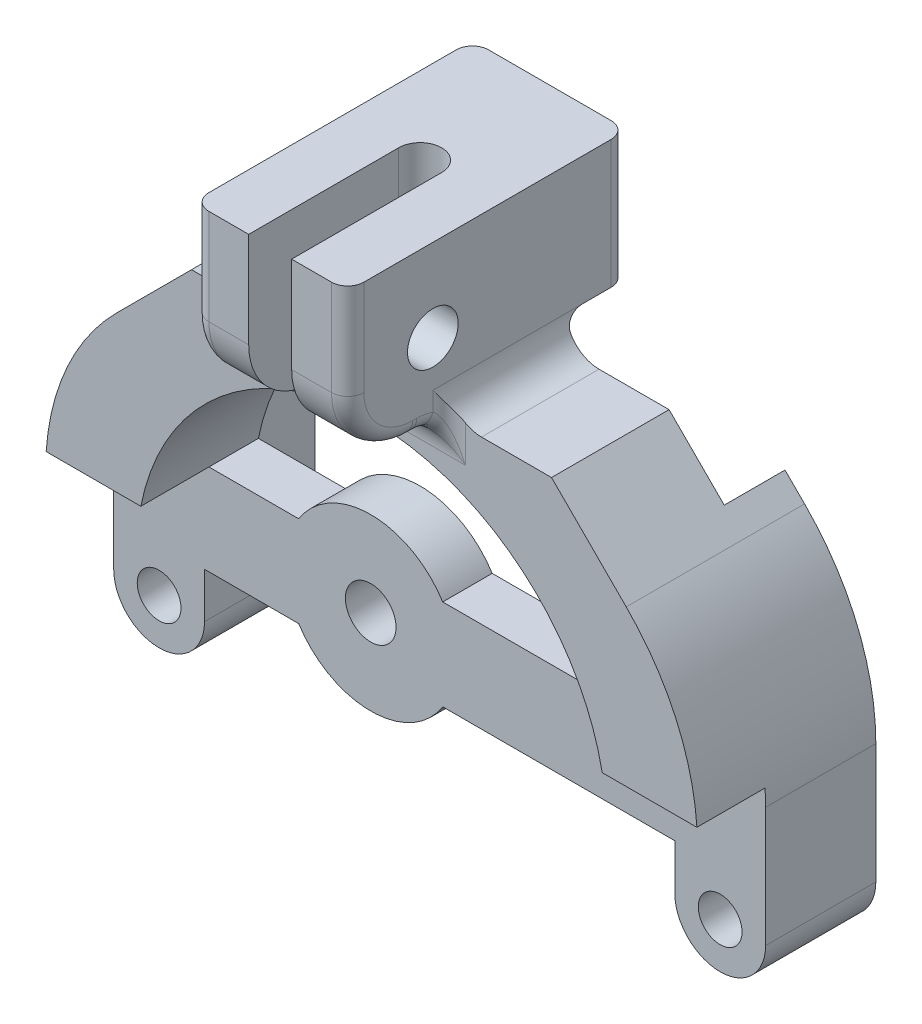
ISO-10303-21;
HEADER;
FILE_DESCRIPTION(('STEP AP214'),'2;1');
FILE_NAME('part.step','',(''),(''),'','','');
FILE_SCHEMA(('AUTOMOTIVE_DESIGN { 1 0 10303 214 1 1 1 1 }'));
ENDSEC;
DATA;
#1=APPLICATION_CONTEXT('core data for automotive mechanical design processes');
#2=APPLICATION_PROTOCOL_DEFINITION('international standard','automotive_design',2000,#1);
#3=PRODUCT_CONTEXT('',#1,'mechanical');
#4=PRODUCT('Part','Part','',(#3));
#5=PRODUCT_RELATED_PRODUCT_CATEGORY('part','',(#4));
#6=PRODUCT_DEFINITION_FORMATION('','',#4);
#7=PRODUCT_DEFINITION_CONTEXT('part definition',#1,'design');
#8=PRODUCT_DEFINITION('design','',#6,#7);
#9=PRODUCT_DEFINITION_SHAPE('','',#8);
#10=(LENGTH_UNIT() NAMED_UNIT(*) SI_UNIT(.MILLI.,.METRE.));
#11=(NAMED_UNIT(*) PLANE_ANGLE_UNIT() SI_UNIT($,.RADIAN.));
#12=(NAMED_UNIT(*) SI_UNIT($,.STERADIAN.) SOLID_ANGLE_UNIT());
#13=UNCERTAINTY_MEASURE_WITH_UNIT(LENGTH_MEASURE(1.E-05),#10,'distance_accuracy_value','');
#14=(GEOMETRIC_REPRESENTATION_CONTEXT(3) GLOBAL_UNCERTAINTY_ASSIGNED_CONTEXT((#13)) GLOBAL_UNIT_ASSIGNED_CONTEXT((#10,
#11,#12)) REPRESENTATION_CONTEXT('',''));
#15=CARTESIAN_POINT('',(0.,0.,0.));
#16=DIRECTION('',(0.,0.,1.));
#17=DIRECTION('',(1.,0.,0.));
#18=AXIS2_PLACEMENT_3D('',#15,#16,#17);
#19=CARTESIAN_POINT('',(-14.5,-1.2,-31.2857410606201));
#20=DIRECTION('',(0.,1.,0.));
#21=DIRECTION('',(0.,0.,1.));
#22=AXIS2_PLACEMENT_3D('',#19,#20,#21);
#23=PLANE('',#22);
#24=DIRECTION('',(0.,0.,1.));
#25=VECTOR('',#24,1.);
#26=CARTESIAN_POINT('',(-8.69100213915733,-1.2,-16.5992424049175));
#27=LINE('',#26,#25);
#28=CARTESIAN_POINT('',(-8.69100213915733,-1.2,-1.75));
#29=VERTEX_POINT('',#28);
#30=CARTESIAN_POINT('',(-8.69100213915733,-1.2,1.3));
#31=VERTEX_POINT('',#30);
#32=EDGE_CURVE('E404',#29,#31,#27,.T.);
#33=ORIENTED_EDGE('',*,*,#32,.F.);
#34=DIRECTION('',(-1.,0.,0.));
#35=VECTOR('',#34,1.);
#36=CARTESIAN_POINT('',(-14.5,-1.2,-1.75));
#37=LINE('',#36,#35);
#38=CARTESIAN_POINT('',(-14.2270868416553,-1.2,-1.75));
#39=VERTEX_POINT('',#38);
#40=EDGE_CURVE('E460',#29,#39,#37,.T.);
#41=ORIENTED_EDGE('',*,*,#40,.T.);
#42=DIRECTION('',(0.,0.,-1.));
#43=VECTOR('',#42,1.);
#44=CARTESIAN_POINT('',(-14.2270868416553,-1.2,5.5));
#45=LINE('',#44,#43);
#46=CARTESIAN_POINT('',(-14.2270868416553,-1.2,1.3));
#47=VERTEX_POINT('',#46);
#48=EDGE_CURVE('E456',#39,#47,#45,.F.);
#49=ORIENTED_EDGE('',*,*,#48,.T.);
#50=DIRECTION('',(-1.,0.,0.));
#51=VECTOR('',#50,1.);
#52=CARTESIAN_POINT('',(14.2270868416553,-1.2,1.3));
#53=LINE('',#52,#51);
#54=EDGE_CURVE('E447',#31,#47,#53,.T.);
#55=ORIENTED_EDGE('',*,*,#54,.F.);
#56=EDGE_LOOP('',(#33,#41,#49,#55));
#57=FACE_BOUND('',#56,.T.);
#58=ADVANCED_FACE('F41',(#57),#23,.T.);
#59=CARTESIAN_POINT('',(-14.5,-6.8,-31.2857410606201));
#60=DIRECTION('',(0.,-1.,0.));
#61=DIRECTION('',(0.,0.,-1.));
#62=AXIS2_PLACEMENT_3D('',#59,#60,#61);
#63=PLANE('',#62);
#64=DIRECTION('',(0.,0.,1.));
#65=VECTOR('',#64,1.);
#66=CARTESIAN_POINT('',(0.191002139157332,-6.8,-16.5992424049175));
#67=LINE('',#66,#65);
#68=CARTESIAN_POINT('',(0.191002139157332,-6.8,-1.75));
#69=VERTEX_POINT('',#68);
#70=CARTESIAN_POINT('',(0.191002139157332,-6.8,1.3));
#71=VERTEX_POINT('',#70);
#72=EDGE_CURVE('E385',#69,#71,#67,.T.);
#73=ORIENTED_EDGE('',*,*,#72,.F.);
#74=DIRECTION('',(1.,0.,0.));
#75=VECTOR('',#74,1.);
#76=CARTESIAN_POINT('',(-14.5,-6.8,-1.75));
#77=LINE('',#76,#75);
#78=CARTESIAN_POINT('',(14.5,-6.8,-1.75));
#79=VERTEX_POINT('',#78);
#80=EDGE_CURVE('E372',#69,#79,#77,.T.);
#81=ORIENTED_EDGE('',*,*,#80,.T.);
#82=DIRECTION('',(0.,0.,1.));
#83=VECTOR('',#82,1.);
#84=CARTESIAN_POINT('',(14.5,-6.8,-31.2857410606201));
#85=LINE('',#84,#83);
#86=CARTESIAN_POINT('',(14.5,-6.8,1.3));
#87=VERTEX_POINT('',#86);
#88=EDGE_CURVE('E457',#79,#87,#85,.T.);
#89=ORIENTED_EDGE('',*,*,#88,.T.);
#90=DIRECTION('',(1.,0.,0.));
#91=VECTOR('',#90,1.);
#92=CARTESIAN_POINT('',(-14.5,-6.8,1.3));
#93=LINE('',#92,#91);
#94=EDGE_CURVE('E387',#71,#87,#93,.T.);
#95=ORIENTED_EDGE('',*,*,#94,.F.);
#96=EDGE_LOOP('',(#73,#81,#89,#95));
#97=FACE_BOUND('',#96,.T.);
#98=ADVANCED_FACE('F386',(#97),#63,.T.);
#99=CARTESIAN_POINT('',(0.,0.,5.5));
#100=DIRECTION('',(0.,0.,1.));
#101=DIRECTION('',(1.,0.,0.));
#102=AXIS2_PLACEMENT_3D('',#99,#100,#101);
#103=PLANE('',#102);
#104=DIRECTION('',(-1.,0.,0.));
#105=VECTOR('',#104,1.);
#106=CARTESIAN_POINT('',(-20.1,-1.2,5.5));
#107=LINE('',#106,#105);
#108=CARTESIAN_POINT('',(-14.2270868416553,-1.2,5.5));
#109=VERTEX_POINT('',#108);
#110=CARTESIAN_POINT('',(-20.0657415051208,-1.2,5.5));
#111=VERTEX_POINT('',#110);
#112=EDGE_CURVE('E407',#109,#111,#107,.T.);
#113=ORIENTED_EDGE('',*,*,#112,.F.);
#114=CARTESIAN_POINT('',(0.,-4.,5.5));
#115=DIRECTION('',(0.,0.,1.));
#116=DIRECTION('',(1.,0.,0.));
#117=AXIS2_PLACEMENT_3D('',#114,#115,#116);
#118=CIRCLE('',#117,14.5);
#119=CARTESIAN_POINT('',(-1.325,10.4393342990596,5.5));
#120=VERTEX_POINT('',#119);
#121=EDGE_CURVE('E603',#120,#109,#118,.T.);
#122=ORIENTED_EDGE('',*,*,#121,.F.);
#123=DIRECTION('',(0.,-1.,0.));
#124=VECTOR('',#123,1.);
#125=CARTESIAN_POINT('',(-1.325,0.,5.5));
#126=LINE('',#125,#124);
#127=CARTESIAN_POINT('',(-1.325,11.,5.5));
#128=VERTEX_POINT('',#127);
#129=EDGE_CURVE('E649',#128,#120,#126,.T.);
#130=ORIENTED_EDGE('',*,*,#129,.F.);
#131=DIRECTION('',(1.,0.,0.));
#132=VECTOR('',#131,1.);
#133=CARTESIAN_POINT('',(-4.78,11.,5.5));
#134=LINE('',#133,#132);
#135=CARTESIAN_POINT('',(-5.78,11.,5.5));
#136=VERTEX_POINT('',#135);
#137=EDGE_CURVE('E1069',#128,#136,#134,.F.);
#138=ORIENTED_EDGE('',*,*,#137,.T.);
#139=DIRECTION('',(0.,1.,0.));
#140=VECTOR('',#139,1.);
#141=CARTESIAN_POINT('',(-5.78,0.,5.5));
#142=LINE('',#141,#140);
#143=CARTESIAN_POINT('',(-5.78,13.2679491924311,5.5));
#144=VERTEX_POINT('',#143);
#145=EDGE_CURVE('E665',#136,#144,#142,.T.);
#146=ORIENTED_EDGE('',*,*,#145,.T.);
#147=CARTESIAN_POINT('',(-6.78,15.,5.5));
#148=DIRECTION('',(0.,0.,1.));
#149=DIRECTION('',(1.,0.,0.));
#150=AXIS2_PLACEMENT_3D('',#147,#148,#149);
#151=CIRCLE('',#150,2.);
#152=CARTESIAN_POINT('',(-6.78,13.,5.5));
#153=VERTEX_POINT('',#152);
#154=EDGE_CURVE('E718',#144,#153,#151,.F.);
#155=ORIENTED_EDGE('',*,*,#154,.T.);
#156=DIRECTION('',(1.,0.,0.));
#157=VECTOR('',#156,1.);
#158=CARTESIAN_POINT('',(0.,13.,5.5));
#159=LINE('',#158,#157);
#160=CARTESIAN_POINT('',(-11.1,13.,5.5));
#161=VERTEX_POINT('',#160);
#162=EDGE_CURVE('E609',#161,#153,#159,.T.);
#163=ORIENTED_EDGE('',*,*,#162,.F.);
#164=DIRECTION('',(0.707106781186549,0.707106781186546,0.));
#165=VECTOR('',#164,1.);
#166=CARTESIAN_POINT('',(-12.05,12.05,5.5));
#167=LINE('',#166,#165);
#168=CARTESIAN_POINT('',(-15.7066017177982,8.39339828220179,5.5));
#169=VERTEX_POINT('',#168);
#170=EDGE_CURVE('E697',#161,#169,#167,.F.);
#171=ORIENTED_EDGE('',*,*,#170,.T.);
#172=CARTESIAN_POINT('',(-5.1,-2.21320343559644,5.5));
#173=DIRECTION('',(0.,0.,1.));
#174=DIRECTION('',(1.,0.,0.));
#175=AXIS2_PLACEMENT_3D('',#172,#173,#174);
#176=CIRCLE('',#175,15.);
#177=EDGE_CURVE('E953',#169,#111,#176,.T.);
#178=ORIENTED_EDGE('',*,*,#177,.T.);
#179=EDGE_LOOP('',(#113,#122,#130,#138,#146,#155,#163,#171,#178));
#180=FACE_BOUND('',#179,.T.);
#181=ADVANCED_FACE('F545',(#180),#103,.T.);
#182=CARTESIAN_POINT('',(-1.325,-12.4,2.5));
#183=DIRECTION('',(-1.,0.,0.));
#184=DIRECTION('',(0.,-1.,0.));
#185=AXIS2_PLACEMENT_3D('',#182,#183,#184);
#186=PLANE('',#185);
#187=CARTESIAN_POINT('',(-1.325,17.8,6.5));
#188=DIRECTION('',(-1.,0.,0.));
#189=DIRECTION('',(0.,-1.,0.));
#190=AXIS2_PLACEMENT_3D('',#187,#188,#189);
#191=CIRCLE('',#190,1.5625);
#192=CARTESIAN_POINT('',(-1.325,16.2375,6.5));
#193=VERTEX_POINT('',#192);
#194=EDGE_CURVE('E1136',#193,#193,#191,.T.);
#195=ORIENTED_EDGE('',*,*,#194,.T.);
#196=EDGE_LOOP('',(#195));
#197=FACE_BOUND('',#196,.T.);
#198=DIRECTION('',(0.,1.,0.));
#199=VECTOR('',#198,1.);
#200=CARTESIAN_POINT('',(-1.325,-12.4,2.5));
#201=LINE('',#200,#199);
#202=CARTESIAN_POINT('',(-1.325,10.4393342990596,2.5));
#203=VERTEX_POINT('',#202);
#204=CARTESIAN_POINT('',(-1.325,22.9,2.5));
#205=VERTEX_POINT('',#204);
#206=EDGE_CURVE('E661',#203,#205,#201,.T.);
#207=ORIENTED_EDGE('',*,*,#206,.T.);
#208=DIRECTION('',(0.,0.,-1.));
#209=VECTOR('',#208,1.);
#210=CARTESIAN_POINT('',(-1.325,22.9,-5.5));
#211=LINE('',#210,#209);
#212=CARTESIAN_POINT('',(-1.325,22.9,11.75));
#213=VERTEX_POINT('',#212);
#214=EDGE_CURVE('E1144',#213,#205,#211,.T.);
#215=ORIENTED_EDGE('',*,*,#214,.F.);
#216=DIRECTION('',(0.,-1.,0.));
#217=VECTOR('',#216,1.);
#218=CARTESIAN_POINT('',(-1.325,22.9,11.75));
#219=LINE('',#218,#217);
#220=CARTESIAN_POINT('',(-1.325,17.,11.75));
#221=VERTEX_POINT('',#220);
#222=EDGE_CURVE('E1077',#213,#221,#219,.T.);
#223=ORIENTED_EDGE('',*,*,#222,.T.);
#224=CARTESIAN_POINT('',(-1.325,17.,7.75));
#225=DIRECTION('',(-1.,0.,0.));
#226=DIRECTION('',(0.,-1.,0.));
#227=AXIS2_PLACEMENT_3D('',#224,#225,#226);
#228=CIRCLE('',#227,4.);
#229=CARTESIAN_POINT('',(-1.325,13.,7.75));
#230=VERTEX_POINT('',#229);
#231=EDGE_CURVE('E1053',#221,#230,#228,.F.);
#232=ORIENTED_EDGE('',*,*,#231,.T.);
#233=DIRECTION('',(0.,0.,-1.));
#234=VECTOR('',#233,1.);
#235=CARTESIAN_POINT('',(-1.325,13.,-5.5));
#236=LINE('',#235,#234);
#237=CARTESIAN_POINT('',(-1.325,13.,7.5));
#238=VERTEX_POINT('',#237);
#239=EDGE_CURVE('E1143',#230,#238,#236,.T.);
#240=ORIENTED_EDGE('',*,*,#239,.T.);
#241=CARTESIAN_POINT('',(-1.325,11.,7.5));
#242=DIRECTION('',(-1.,0.,0.));
#243=DIRECTION('',(0.,-1.,0.));
#244=AXIS2_PLACEMENT_3D('',#241,#242,#243);
#245=CIRCLE('',#244,2.);
#246=EDGE_CURVE('E1013',#238,#128,#245,.T.);
#247=ORIENTED_EDGE('',*,*,#246,.T.);
#248=ORIENTED_EDGE('',*,*,#129,.T.);
#249=DIRECTION('',(0.,0.,1.));
#250=VECTOR('',#249,1.);
#251=CARTESIAN_POINT('',(-1.325,10.4393342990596,-2.));
#252=LINE('',#251,#250);
#253=EDGE_CURVE('E605',#120,#203,#252,.F.);
#254=ORIENTED_EDGE('',*,*,#253,.T.);
#255=EDGE_LOOP('',(#207,#215,#223,#232,#240,#247,#248,#254));
#256=FACE_BOUND('',#255,.T.);
#257=ADVANCED_FACE('F542',(#197,#256),#186,.F.);
#258=CARTESIAN_POINT('',(0.,13.,5.5));
#259=DIRECTION('',(0.,1.,0.));
#260=DIRECTION('',(-1.,0.,0.));
#261=AXIS2_PLACEMENT_3D('',#258,#259,#260);
#262=PLANE('',#261);
#263=ORIENTED_EDGE('',*,*,#162,.T.);
#264=DIRECTION('',(0.,0.,1.));
#265=VECTOR('',#264,1.);
#266=CARTESIAN_POINT('',(-6.78,13.,5.5));
#267=LINE('',#266,#265);
#268=CARTESIAN_POINT('',(-6.78,13.,-1.75));
#269=VERTEX_POINT('',#268);
#270=EDGE_CURVE('E703',#153,#269,#267,.F.);
#271=ORIENTED_EDGE('',*,*,#270,.T.);
#272=DIRECTION('',(-1.,0.,0.));
#273=VECTOR('',#272,1.);
#274=CARTESIAN_POINT('',(0.,13.,-1.75));
#275=LINE('',#274,#273);
#276=CARTESIAN_POINT('',(-11.1,13.,-1.75));
#277=VERTEX_POINT('',#276);
#278=EDGE_CURVE('E1091',#269,#277,#275,.T.);
#279=ORIENTED_EDGE('',*,*,#278,.T.);
#280=DIRECTION('',(0.,0.,1.));
#281=VECTOR('',#280,1.);
#282=CARTESIAN_POINT('',(-11.1,13.,5.5));
#283=LINE('',#282,#281);
#284=EDGE_CURVE('E695',#277,#161,#283,.T.);
#285=ORIENTED_EDGE('',*,*,#284,.T.);
#286=EDGE_LOOP('',(#263,#271,#279,#285));
#287=FACE_BOUND('',#286,.T.);
#288=ADVANCED_FACE('F544',(#287),#262,.T.);
#289=CARTESIAN_POINT('',(11.1,13.,-1.75));
#290=VERTEX_POINT('',#289);
#291=CARTESIAN_POINT('',(6.78,13.,-1.75));
#292=VERTEX_POINT('',#291);
#293=EDGE_CURVE('E622',#290,#292,#275,.T.);
#294=ORIENTED_EDGE('',*,*,#293,.T.);
#295=DIRECTION('',(0.,0.,-1.));
#296=VECTOR('',#295,1.);
#297=CARTESIAN_POINT('',(6.78,13.,5.5));
#298=LINE('',#297,#296);
#299=CARTESIAN_POINT('',(6.78,13.,5.5));
#300=VERTEX_POINT('',#299);
#301=EDGE_CURVE('E708',#292,#300,#298,.F.);
#302=ORIENTED_EDGE('',*,*,#301,.T.);
#303=CARTESIAN_POINT('',(11.1,13.,5.5));
#304=VERTEX_POINT('',#303);
#305=EDGE_CURVE('E614',#300,#304,#159,.T.);
#306=ORIENTED_EDGE('',*,*,#305,.T.);
#307=DIRECTION('',(0.,0.,-1.));
#308=VECTOR('',#307,1.);
#309=CARTESIAN_POINT('',(11.1,13.,-5.5));
#310=LINE('',#309,#308);
#311=EDGE_CURVE('E675',#304,#290,#310,.T.);
#312=ORIENTED_EDGE('',*,*,#311,.T.);
#313=EDGE_LOOP('',(#294,#302,#306,#312));
#314=FACE_BOUND('',#313,.T.);
#315=ADVANCED_FACE('F551',(#314),#262,.T.);
#316=CARTESIAN_POINT('',(0.,-4.,5.5));
#317=DIRECTION('',(0.,0.,-1.));
#318=DIRECTION('',(-1.,0.,0.));
#319=AXIS2_PLACEMENT_3D('',#316,#317,#318);
#320=CYLINDRICAL_SURFACE('',#319,14.5);
#321=DIRECTION('',(0.,0.,-1.));
#322=VECTOR('',#321,1.);
#323=CARTESIAN_POINT('',(14.2270868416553,-1.2,5.5));
#324=LINE('',#323,#322);
#325=CARTESIAN_POINT('',(14.2270868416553,-1.2,5.5));
#326=VERTEX_POINT('',#325);
#327=CARTESIAN_POINT('',(14.2270868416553,-1.2,1.3));
#328=VERTEX_POINT('',#327);
#329=EDGE_CURVE('E424',#326,#328,#324,.T.);
#330=ORIENTED_EDGE('',*,*,#329,.F.);
#331=CARTESIAN_POINT('',(0.,-4.,5.5));
#332=DIRECTION('',(0.,0.,1.));
#333=DIRECTION('',(1.,0.,0.));
#334=AXIS2_PLACEMENT_3D('',#331,#332,#333);
#335=CIRCLE('',#334,14.5);
#336=CARTESIAN_POINT('',(1.325,10.4393342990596,5.5));
#337=VERTEX_POINT('',#336);
#338=EDGE_CURVE('E642',#326,#337,#335,.T.);
#339=ORIENTED_EDGE('',*,*,#338,.T.);
#340=DIRECTION('',(0.,0.,1.));
#341=VECTOR('',#340,1.);
#342=CARTESIAN_POINT('',(1.325,10.4393342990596,-2.));
#343=LINE('',#342,#341);
#344=CARTESIAN_POINT('',(1.325,10.4393342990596,2.5));
#345=VERTEX_POINT('',#344);
#346=EDGE_CURVE('E490',#345,#337,#343,.T.);
#347=ORIENTED_EDGE('',*,*,#346,.F.);
#348=CARTESIAN_POINT('',(-1.325,10.4393342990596,2.5));
#349=CARTESIAN_POINT('',(-1.32499984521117,10.4393334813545,2.46280514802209));
#350=CARTESIAN_POINT('',(-1.32343283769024,10.4394781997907,2.42562819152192));
#351=CARTESIAN_POINT('',(-1.31718201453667,10.4400500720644,2.35154182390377));
#352=CARTESIAN_POINT('',(-1.31249839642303,10.4404772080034,2.31463239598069));
#353=CARTESIAN_POINT('',(-1.29381969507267,10.4421673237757,2.20477544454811));
#354=CARTESIAN_POINT('',(-1.27519662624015,10.4438390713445,2.13256622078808));
#355=CARTESIAN_POINT('',(-1.22613759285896,10.4480858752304,1.99231828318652));
#356=CARTESIAN_POINT('',(-1.19569700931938,10.4506612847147,1.92428121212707));
#357=CARTESIAN_POINT('',(-1.12387540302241,10.4564240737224,1.79428060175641));
#358=CARTESIAN_POINT('',(-1.08249583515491,10.4596113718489,1.73231625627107));
#359=CARTESIAN_POINT('',(-0.989840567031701,10.4662494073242,1.61604156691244));
#360=CARTESIAN_POINT('',(-0.938539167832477,10.4697008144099,1.56175174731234));
#361=CARTESIAN_POINT('',(-0.827544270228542,10.4764724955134,1.46253337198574));
#362=CARTESIAN_POINT('',(-0.767849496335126,10.4797927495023,1.41760624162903));
#363=CARTESIAN_POINT('',(-0.641639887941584,10.4859342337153,1.33832609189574));
#364=CARTESIAN_POINT('',(-0.575113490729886,10.4887545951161,1.30399140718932));
#365=CARTESIAN_POINT('',(-0.437213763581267,10.4935709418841,1.24698970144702));
#366=CARTESIAN_POINT('',(-0.365840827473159,10.4955669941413,1.2243217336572));
#367=CARTESIAN_POINT('',(-0.220481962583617,10.4985052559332,1.19135521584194));
#368=CARTESIAN_POINT('',(-0.14650389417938,10.4994503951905,1.18102227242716));
#369=CARTESIAN_POINT('',(0.00214395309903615,10.5001902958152,1.17291268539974));
#370=CARTESIAN_POINT('',(0.0768137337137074,10.4999850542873,1.17513607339));
#371=CARTESIAN_POINT('',(0.224487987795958,10.498449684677,1.19204845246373));
#372=CARTESIAN_POINT('',(0.297496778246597,10.4971229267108,1.2067000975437));
#373=CARTESIAN_POINT('',(0.440014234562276,10.4934975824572,1.24799490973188));
#374=CARTESIAN_POINT('',(0.509522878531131,10.4911989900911,1.27463815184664));
#375=CARTESIAN_POINT('',(0.643186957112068,10.4858826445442,1.33920174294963));
#376=CARTESIAN_POINT('',(0.707334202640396,10.482863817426,1.37713895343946));
#377=CARTESIAN_POINT('',(0.828361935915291,10.4764462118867,1.46319964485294));
#378=CARTESIAN_POINT('',(0.885242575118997,10.4730474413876,1.51132291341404));
#379=CARTESIAN_POINT('',(0.990336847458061,10.4662373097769,1.61659217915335));
#380=CARTESIAN_POINT('',(1.03851922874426,10.4628259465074,1.67376937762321));
#381=CARTESIAN_POINT('',(1.12462157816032,10.4563860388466,1.79543937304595));
#382=CARTESIAN_POINT('',(1.16253840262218,10.4533576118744,1.85993440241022));
#383=CARTESIAN_POINT('',(1.22703131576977,10.4480256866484,1.99444062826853));
#384=CARTESIAN_POINT('',(1.25359880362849,10.4457227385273,2.06445596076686));
#385=CARTESIAN_POINT('',(1.29455213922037,10.442110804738,2.20792682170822));
#386=CARTESIAN_POINT('',(1.30895644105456,10.4408003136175,2.28137695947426));
#387=CARTESIAN_POINT('',(1.31972716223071,10.4398172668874,2.3794474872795));
#388=CARTESIAN_POINT('',(1.32170546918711,10.4396362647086,2.40353650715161));
#389=CARTESIAN_POINT('',(1.32434009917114,10.4393949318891,2.45174701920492));
#390=CARTESIAN_POINT('',(1.32499862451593,10.4393344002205,2.47586838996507));
#391=CARTESIAN_POINT('',(1.325,10.4393342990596,2.5));
#392=B_SPLINE_CURVE_WITH_KNOTS('',3,(#348,#349,#350,#351,#352,#353,#354,#355,#356,#357,#358,
#359,#360,#361,#362,#363,#364,#365,#366,#367,#368,#369,#370,#371,#372,#373,#374,#375,#376,#377,
#378,#379,#380,#381,#382,#383,#384,#385,#386,#387,#388,#389,#390,#391),.UNSPECIFIED.,.F.,.F.,(4,
2,2,2,2,2,2,2,2,2,2,2,2,2,2,2,2,2,2,2,2,4),(0.,0.111515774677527,0.223024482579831,
0.445647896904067,0.668358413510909,0.891039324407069,1.1143049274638,1.33760449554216,
1.56128843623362,1.78495422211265,2.00799489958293,2.23103613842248,2.45340951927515,
2.6757842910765,2.89849273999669,3.12119654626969,3.34468523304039,3.56824228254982,
3.79196845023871,4.01535456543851,4.08784092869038,4.16020623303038),.UNSPECIFIED.);
#393=EDGE_CURVE('E477',#203,#345,#392,.T.);
#394=ORIENTED_EDGE('',*,*,#393,.F.);
#395=ORIENTED_EDGE('',*,*,#253,.F.);
#396=ORIENTED_EDGE('',*,*,#121,.T.);
#397=DIRECTION('',(0.,0.,-1.));
#398=VECTOR('',#397,1.);
#399=CARTESIAN_POINT('',(-14.2270868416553,-1.2,5.5));
#400=LINE('',#399,#398);
#401=EDGE_CURVE('E422',#47,#109,#400,.F.);
#402=ORIENTED_EDGE('',*,*,#401,.F.);
#403=ORIENTED_EDGE('',*,*,#48,.F.);
#404=CARTESIAN_POINT('',(0.,-4.,-1.75));
#405=DIRECTION('',(0.,0.,-1.));
#406=DIRECTION('',(-1.,0.,0.));
#407=AXIS2_PLACEMENT_3D('',#404,#405,#406);
#408=CIRCLE('',#407,14.5);
#409=CARTESIAN_POINT('',(14.2270868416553,-1.2,-1.75));
#410=VERTEX_POINT('',#409);
#411=EDGE_CURVE('E1089',#39,#410,#408,.T.);
#412=ORIENTED_EDGE('',*,*,#411,.T.);
#413=DIRECTION('',(0.,0.,-1.));
#414=VECTOR('',#413,1.);
#415=CARTESIAN_POINT('',(14.2270868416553,-1.2,5.5));
#416=LINE('',#415,#414);
#417=EDGE_CURVE('E467',#328,#410,#416,.T.);
#418=ORIENTED_EDGE('',*,*,#417,.F.);
#419=EDGE_LOOP('',(#330,#339,#347,#394,#395,#396,#402,#403,#412,#418));
#420=FACE_BOUND('',#419,.T.);
#421=ADVANCED_FACE('F599',(#420),#320,.F.);
#422=CARTESIAN_POINT('',(0.,0.,-5.5));
#423=DIRECTION('',(0.,0.,1.));
#424=DIRECTION('',(1.,0.,0.));
#425=AXIS2_PLACEMENT_3D('',#422,#423,#424);
#426=PLANE('',#425);
#427=CARTESIAN_POINT('',(17.3,-9.59999999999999,-5.5));
#428=DIRECTION('',(0.,0.,1.));
#429=DIRECTION('',(1.,0.,0.));
#430=AXIS2_PLACEMENT_3D('',#427,#428,#429);
#431=CIRCLE('',#430,1.35);
#432=CARTESIAN_POINT('',(18.65,-9.59999999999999,-5.5));
#433=VERTEX_POINT('',#432);
#434=EDGE_CURVE('E621',#433,#433,#431,.T.);
#435=ORIENTED_EDGE('',*,*,#434,.T.);
#436=EDGE_LOOP('',(#435));
#437=FACE_BOUND('',#436,.T.);
#438=DIRECTION('',(0.707106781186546,-0.707106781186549,0.));
#439=VECTOR('',#438,1.);
#440=CARTESIAN_POINT('',(11.1,13.,-5.5));
#441=LINE('',#440,#439);
#442=CARTESIAN_POINT('',(14.5,9.59999999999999,-5.5));
#443=VERTEX_POINT('',#442);
#444=CARTESIAN_POINT('',(15.7066017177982,8.39339828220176,-5.5));
#445=VERTEX_POINT('',#444);
#446=EDGE_CURVE('E685',#443,#445,#441,.T.);
#447=ORIENTED_EDGE('',*,*,#446,.T.);
#448=CARTESIAN_POINT('',(5.1,-2.21320343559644,-5.5));
#449=DIRECTION('',(0.,0.,1.));
#450=DIRECTION('',(1.,0.,0.));
#451=AXIS2_PLACEMENT_3D('',#448,#449,#450);
#452=CIRCLE('',#451,15.);
#453=CARTESIAN_POINT('',(20.1,-2.21320343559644,-5.5));
#454=VERTEX_POINT('',#453);
#455=EDGE_CURVE('E945',#445,#454,#452,.F.);
#456=ORIENTED_EDGE('',*,*,#455,.T.);
#457=DIRECTION('',(0.,1.,0.));
#458=VECTOR('',#457,1.);
#459=CARTESIAN_POINT('',(20.1,0.,-5.5));
#460=LINE('',#459,#458);
#461=CARTESIAN_POINT('',(20.1,-9.6,-5.5));
#462=VERTEX_POINT('',#461);
#463=EDGE_CURVE('E631',#462,#454,#460,.T.);
#464=ORIENTED_EDGE('',*,*,#463,.F.);
#465=CARTESIAN_POINT('',(17.3,-9.59999999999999,-5.5));
#466=DIRECTION('',(0.,0.,1.));
#467=DIRECTION('',(1.,0.,0.));
#468=AXIS2_PLACEMENT_3D('',#465,#466,#467);
#469=CIRCLE('',#468,2.8);
#470=CARTESIAN_POINT('',(14.5,-9.6,-5.5));
#471=VERTEX_POINT('',#470);
#472=EDGE_CURVE('E628',#471,#462,#469,.T.);
#473=ORIENTED_EDGE('',*,*,#472,.F.);
#474=DIRECTION('',(0.,1.,0.));
#475=VECTOR('',#474,1.);
#476=CARTESIAN_POINT('',(14.5,0.,-5.5));
#477=LINE('',#476,#475);
#478=EDGE_CURVE('E625',#471,#443,#477,.T.);
#479=ORIENTED_EDGE('',*,*,#478,.T.);
#480=EDGE_LOOP('',(#447,#456,#464,#473,#479));
#481=FACE_BOUND('',#480,.T.);
#482=ADVANCED_FACE('F1118',(#437,#481),#426,.F.);
#483=CARTESIAN_POINT('',(14.5,0.,5.5));
#484=DIRECTION('',(-1.,0.,0.));
#485=DIRECTION('',(0.,0.,1.));
#486=AXIS2_PLACEMENT_3D('',#483,#484,#485);
#487=PLANE('',#486);
#488=DIRECTION('',(0.,-1.,0.));
#489=VECTOR('',#488,1.);
#490=CARTESIAN_POINT('',(14.5,0.,1.3));
#491=LINE('',#490,#489);
#492=CARTESIAN_POINT('',(14.5,-9.6,1.3));
#493=VERTEX_POINT('',#492);
#494=EDGE_CURVE('E431',#87,#493,#491,.T.);
#495=ORIENTED_EDGE('',*,*,#494,.F.);
#496=ORIENTED_EDGE('',*,*,#88,.F.);
#497=DIRECTION('',(0.,-1.,0.));
#498=VECTOR('',#497,1.);
#499=CARTESIAN_POINT('',(14.5,-4.,-1.75));
#500=LINE('',#499,#498);
#501=CARTESIAN_POINT('',(14.5,9.59999999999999,-1.75));
#502=VERTEX_POINT('',#501);
#503=EDGE_CURVE('E379',#502,#79,#500,.T.);
#504=ORIENTED_EDGE('',*,*,#503,.F.);
#505=DIRECTION('',(0.,0.,-1.));
#506=VECTOR('',#505,1.);
#507=CARTESIAN_POINT('',(14.5,9.59999999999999,5.5));
#508=LINE('',#507,#506);
#509=EDGE_CURVE('E683',#502,#443,#508,.T.);
#510=ORIENTED_EDGE('',*,*,#509,.T.);
#511=ORIENTED_EDGE('',*,*,#478,.F.);
#512=DIRECTION('',(0.,0.,-1.));
#513=VECTOR('',#512,1.);
#514=CARTESIAN_POINT('',(14.5,-9.6,5.5));
#515=LINE('',#514,#513);
#516=EDGE_CURVE('E647',#493,#471,#515,.T.);
#517=ORIENTED_EDGE('',*,*,#516,.F.);
#518=EDGE_LOOP('',(#495,#496,#504,#510,#511,#517));
#519=FACE_BOUND('',#518,.T.);
#520=ADVANCED_FACE('F1105',(#519),#487,.T.);
#521=CARTESIAN_POINT('',(17.3,-9.59999999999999,5.5));
#522=DIRECTION('',(0.,0.,-1.));
#523=DIRECTION('',(-1.,0.,0.));
#524=AXIS2_PLACEMENT_3D('',#521,#522,#523);
#525=CYLINDRICAL_SURFACE('',#524,2.8);
#526=DIRECTION('',(0.,0.,-1.));
#527=VECTOR('',#526,1.);
#528=CARTESIAN_POINT('',(20.1,-9.6,5.5));
#529=LINE('',#528,#527);
#530=CARTESIAN_POINT('',(20.1,-9.6,1.3));
#531=VERTEX_POINT('',#530);
#532=EDGE_CURVE('E645',#531,#462,#529,.T.);
#533=ORIENTED_EDGE('',*,*,#532,.F.);
#534=CARTESIAN_POINT('',(17.3,-9.59999999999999,1.3));
#535=DIRECTION('',(0.,0.,-1.));
#536=DIRECTION('',(-1.,0.,0.));
#537=AXIS2_PLACEMENT_3D('',#534,#535,#536);
#538=CIRCLE('',#537,2.8);
#539=EDGE_CURVE('E433',#531,#493,#538,.T.);
#540=ORIENTED_EDGE('',*,*,#539,.T.);
#541=ORIENTED_EDGE('',*,*,#516,.T.);
#542=ORIENTED_EDGE('',*,*,#472,.T.);
#543=EDGE_LOOP('',(#533,#540,#541,#542));
#544=FACE_BOUND('',#543,.T.);
#545=ADVANCED_FACE('F1111',(#544),#525,.T.);
#546=CARTESIAN_POINT('',(20.1,0.,5.5));
#547=DIRECTION('',(-1.,0.,0.));
#548=DIRECTION('',(0.,-1.,0.));
#549=AXIS2_PLACEMENT_3D('',#546,#547,#548);
#550=PLANE('',#549);
#551=DIRECTION('',(0.,0.,1.));
#552=VECTOR('',#551,1.);
#553=CARTESIAN_POINT('',(20.1,-2.21320343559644,5.5));
#554=LINE('',#553,#552);
#555=CARTESIAN_POINT('',(20.1,-2.21320343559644,1.3));
#556=VERTEX_POINT('',#555);
#557=EDGE_CURVE('E936',#454,#556,#554,.T.);
#558=ORIENTED_EDGE('',*,*,#557,.T.);
#559=DIRECTION('',(0.,1.,0.));
#560=VECTOR('',#559,1.);
#561=CARTESIAN_POINT('',(20.1,-1.2,1.3));
#562=LINE('',#561,#560);
#563=EDGE_CURVE('E417',#531,#556,#562,.T.);
#564=ORIENTED_EDGE('',*,*,#563,.F.);
#565=ORIENTED_EDGE('',*,*,#532,.T.);
#566=ORIENTED_EDGE('',*,*,#463,.T.);
#567=EDGE_LOOP('',(#558,#564,#565,#566));
#568=FACE_BOUND('',#567,.T.);
#569=ADVANCED_FACE('F1115',(#568),#550,.F.);
#570=CARTESIAN_POINT('',(-20.1,0.,5.5));
#571=DIRECTION('',(-1.,0.,0.));
#572=DIRECTION('',(0.,-1.,0.));
#573=AXIS2_PLACEMENT_3D('',#570,#571,#572);
#574=PLANE('',#573);
#575=DIRECTION('',(0.,-1.,0.));
#576=VECTOR('',#575,1.);
#577=CARTESIAN_POINT('',(-20.1,-1.2,1.3));
#578=LINE('',#577,#576);
#579=CARTESIAN_POINT('',(-20.1,-2.21320343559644,1.3));
#580=VERTEX_POINT('',#579);
#581=CARTESIAN_POINT('',(-20.1,-9.6,1.3));
#582=VERTEX_POINT('',#581);
#583=EDGE_CURVE('E410',#580,#582,#578,.T.);
#584=ORIENTED_EDGE('',*,*,#583,.F.);
#585=DIRECTION('',(0.,0.,1.));
#586=VECTOR('',#585,1.);
#587=CARTESIAN_POINT('',(-20.1,-2.21320343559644,5.5));
#588=LINE('',#587,#586);
#589=CARTESIAN_POINT('',(-20.1,-2.21320343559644,-5.5));
#590=VERTEX_POINT('',#589);
#591=EDGE_CURVE('E947',#580,#590,#588,.F.);
#592=ORIENTED_EDGE('',*,*,#591,.T.);
#593=DIRECTION('',(0.,1.,0.));
#594=VECTOR('',#593,1.);
#595=CARTESIAN_POINT('',(-20.1,0.,-5.5));
#596=LINE('',#595,#594);
#597=CARTESIAN_POINT('',(-20.1,-9.6,-5.5));
#598=VERTEX_POINT('',#597);
#599=EDGE_CURVE('E634',#598,#590,#596,.T.);
#600=ORIENTED_EDGE('',*,*,#599,.F.);
#601=DIRECTION('',(0.,0.,-1.));
#602=VECTOR('',#601,1.);
#603=CARTESIAN_POINT('',(-20.1,-9.6,5.5));
#604=LINE('',#603,#602);
#605=EDGE_CURVE('E611',#582,#598,#604,.T.);
#606=ORIENTED_EDGE('',*,*,#605,.F.);
#607=EDGE_LOOP('',(#584,#592,#600,#606));
#608=FACE_BOUND('',#607,.T.);
#609=ADVANCED_FACE('F1192',(#608),#574,.T.);
#610=CARTESIAN_POINT('',(-17.3,-9.6,5.5));
#611=DIRECTION('',(0.,0.,-1.));
#612=DIRECTION('',(-1.,0.,0.));
#613=AXIS2_PLACEMENT_3D('',#610,#611,#612);
#614=CYLINDRICAL_SURFACE('',#613,2.8);
#615=CARTESIAN_POINT('',(-17.3,-9.6,1.3));
#616=DIRECTION('',(0.,0.,-1.));
#617=DIRECTION('',(-1.,0.,0.));
#618=AXIS2_PLACEMENT_3D('',#615,#616,#617);
#619=CIRCLE('',#618,2.8);
#620=CARTESIAN_POINT('',(-14.5,-9.6,1.3));
#621=VERTEX_POINT('',#620);
#622=EDGE_CURVE('E429',#582,#621,#619,.F.);
#623=ORIENTED_EDGE('',*,*,#622,.F.);
#624=ORIENTED_EDGE('',*,*,#605,.T.);
#625=CARTESIAN_POINT('',(-17.3,-9.6,-5.5));
#626=DIRECTION('',(0.,0.,1.));
#627=DIRECTION('',(1.,0.,0.));
#628=AXIS2_PLACEMENT_3D('',#625,#626,#627);
#629=CIRCLE('',#628,2.8);
#630=CARTESIAN_POINT('',(-14.5,-9.6,-5.5));
#631=VERTEX_POINT('',#630);
#632=EDGE_CURVE('E637',#631,#598,#629,.F.);
#633=ORIENTED_EDGE('',*,*,#632,.F.);
#634=DIRECTION('',(0.,0.,-1.));
#635=VECTOR('',#634,1.);
#636=CARTESIAN_POINT('',(-14.5,-9.6,5.5));
#637=LINE('',#636,#635);
#638=EDGE_CURVE('E608',#621,#631,#637,.T.);
#639=ORIENTED_EDGE('',*,*,#638,.F.);
#640=EDGE_LOOP('',(#623,#624,#633,#639));
#641=FACE_BOUND('',#640,.T.);
#642=ADVANCED_FACE('F1196',(#641),#614,.T.);
#643=CARTESIAN_POINT('',(-14.5,0.,5.5));
#644=DIRECTION('',(-1.,0.,0.));
#645=DIRECTION('',(0.,-1.,0.));
#646=AXIS2_PLACEMENT_3D('',#643,#644,#645);
#647=PLANE('',#646);
#648=DIRECTION('',(0.,0.,1.));
#649=VECTOR('',#648,1.);
#650=CARTESIAN_POINT('',(-14.5,-6.8,-31.2857410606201));
#651=LINE('',#650,#649);
#652=CARTESIAN_POINT('',(-14.5,-6.8,-1.75));
#653=VERTEX_POINT('',#652);
#654=CARTESIAN_POINT('',(-14.5,-6.8,1.3));
#655=VERTEX_POINT('',#654);
#656=EDGE_CURVE('E462',#653,#655,#651,.T.);
#657=ORIENTED_EDGE('',*,*,#656,.T.);
#658=DIRECTION('',(0.,-1.,0.));
#659=VECTOR('',#658,1.);
#660=CARTESIAN_POINT('',(-14.5,0.,1.3));
#661=LINE('',#660,#659);
#662=EDGE_CURVE('E426',#655,#621,#661,.T.);
#663=ORIENTED_EDGE('',*,*,#662,.T.);
#664=ORIENTED_EDGE('',*,*,#638,.T.);
#665=DIRECTION('',(0.,1.,0.));
#666=VECTOR('',#665,1.);
#667=CARTESIAN_POINT('',(-14.5,0.,-5.5));
#668=LINE('',#667,#666);
#669=CARTESIAN_POINT('',(-14.5,9.59999999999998,-5.5));
#670=VERTEX_POINT('',#669);
#671=EDGE_CURVE('E640',#631,#670,#668,.T.);
#672=ORIENTED_EDGE('',*,*,#671,.T.);
#673=DIRECTION('',(0.,0.,-1.));
#674=VECTOR('',#673,1.);
#675=CARTESIAN_POINT('',(-14.5,9.59999999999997,5.5));
#676=LINE('',#675,#674);
#677=CARTESIAN_POINT('',(-14.5,9.59999999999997,-1.75));
#678=VERTEX_POINT('',#677);
#679=EDGE_CURVE('E692',#670,#678,#676,.F.);
#680=ORIENTED_EDGE('',*,*,#679,.T.);
#681=DIRECTION('',(0.,1.,0.));
#682=VECTOR('',#681,1.);
#683=CARTESIAN_POINT('',(-14.5,-4.,-1.75));
#684=LINE('',#683,#682);
#685=EDGE_CURVE('E660',#653,#678,#684,.T.);
#686=ORIENTED_EDGE('',*,*,#685,.F.);
#687=EDGE_LOOP('',(#657,#663,#664,#672,#680,#686));
#688=FACE_BOUND('',#687,.T.);
#689=ADVANCED_FACE('F1200',(#688),#647,.F.);
#690=CARTESIAN_POINT('',(17.3,-9.59999999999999,5.5));
#691=DIRECTION('',(0.,0.,-1.));
#692=DIRECTION('',(-1.,0.,0.));
#693=AXIS2_PLACEMENT_3D('',#690,#691,#692);
#694=CYLINDRICAL_SURFACE('',#693,1.35);
#695=CARTESIAN_POINT('',(17.3,-9.59999999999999,1.3));
#696=DIRECTION('',(0.,0.,-1.));
#697=DIRECTION('',(-1.,0.,0.));
#698=AXIS2_PLACEMENT_3D('',#695,#696,#697);
#699=CIRCLE('',#698,1.35);
#700=CARTESIAN_POINT('',(15.95,-9.59999999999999,1.3));
#701=VERTEX_POINT('',#700);
#702=EDGE_CURVE('E444',#701,#701,#699,.T.);
#703=ORIENTED_EDGE('',*,*,#702,.F.);
#704=EDGE_LOOP('',(#703));
#705=FACE_BOUND('',#704,.T.);
#706=ORIENTED_EDGE('',*,*,#434,.F.);
#707=EDGE_LOOP('',(#706));
#708=FACE_BOUND('',#707,.T.);
#709=ADVANCED_FACE('F1223',(#705,#708),#694,.F.);
#710=CARTESIAN_POINT('',(-17.3,-9.6,5.5));
#711=DIRECTION('',(0.,0.,-1.));
#712=DIRECTION('',(-1.,0.,0.));
#713=AXIS2_PLACEMENT_3D('',#710,#711,#712);
#714=CYLINDRICAL_SURFACE('',#713,1.35);
#715=CARTESIAN_POINT('',(-17.3,-9.6,1.3));
#716=DIRECTION('',(0.,0.,-1.));
#717=DIRECTION('',(-1.,0.,0.));
#718=AXIS2_PLACEMENT_3D('',#715,#716,#717);
#719=CIRCLE('',#718,1.35);
#720=CARTESIAN_POINT('',(-18.65,-9.6,1.3));
#721=VERTEX_POINT('',#720);
#722=EDGE_CURVE('E441',#721,#721,#719,.F.);
#723=ORIENTED_EDGE('',*,*,#722,.T.);
#724=EDGE_LOOP('',(#723));
#725=FACE_BOUND('',#724,.T.);
#726=CARTESIAN_POINT('',(-17.3,-9.6,-5.5));
#727=DIRECTION('',(0.,0.,1.));
#728=DIRECTION('',(1.,0.,0.));
#729=AXIS2_PLACEMENT_3D('',#726,#727,#728);
#730=CIRCLE('',#729,1.35);
#731=CARTESIAN_POINT('',(-15.95,-9.6,-5.5));
#732=VERTEX_POINT('',#731);
#733=EDGE_CURVE('E618',#732,#732,#730,.F.);
#734=ORIENTED_EDGE('',*,*,#733,.T.);
#735=EDGE_LOOP('',(#734));
#736=FACE_BOUND('',#735,.T.);
#737=ADVANCED_FACE('F1211',(#725,#736),#714,.F.);
#738=CARTESIAN_POINT('',(20.0657415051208,-1.2,5.5));
#739=VERTEX_POINT('',#738);
#740=EDGE_CURVE('E409',#739,#326,#107,.T.);
#741=ORIENTED_EDGE('',*,*,#740,.F.);
#742=CARTESIAN_POINT('',(5.1,-2.21320343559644,5.5));
#743=DIRECTION('',(0.,0.,1.));
#744=DIRECTION('',(1.,0.,0.));
#745=AXIS2_PLACEMENT_3D('',#742,#743,#744);
#746=CIRCLE('',#745,15.);
#747=CARTESIAN_POINT('',(15.7066017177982,8.39339828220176,5.5));
#748=VERTEX_POINT('',#747);
#749=EDGE_CURVE('E941',#739,#748,#746,.T.);
#750=ORIENTED_EDGE('',*,*,#749,.T.);
#751=DIRECTION('',(-0.707106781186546,0.707106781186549,0.));
#752=VECTOR('',#751,1.);
#753=CARTESIAN_POINT('',(12.05,12.05,5.5));
#754=LINE('',#753,#752);
#755=EDGE_CURVE('E688',#748,#304,#754,.T.);
#756=ORIENTED_EDGE('',*,*,#755,.T.);
#757=ORIENTED_EDGE('',*,*,#305,.F.);
#758=CARTESIAN_POINT('',(6.78,15.,5.5));
#759=DIRECTION('',(0.,0.,1.));
#760=DIRECTION('',(1.,0.,0.));
#761=AXIS2_PLACEMENT_3D('',#758,#759,#760);
#762=CIRCLE('',#761,2.);
#763=CARTESIAN_POINT('',(5.78,13.2679491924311,5.5));
#764=VERTEX_POINT('',#763);
#765=EDGE_CURVE('E937',#300,#764,#762,.F.);
#766=ORIENTED_EDGE('',*,*,#765,.T.);
#767=DIRECTION('',(0.,-1.,0.));
#768=VECTOR('',#767,1.);
#769=CARTESIAN_POINT('',(5.78,0.,5.5));
#770=LINE('',#769,#768);
#771=CARTESIAN_POINT('',(5.78,11.,5.5));
#772=VERTEX_POINT('',#771);
#773=EDGE_CURVE('E670',#764,#772,#770,.T.);
#774=ORIENTED_EDGE('',*,*,#773,.T.);
#775=DIRECTION('',(1.,0.,0.));
#776=VECTOR('',#775,1.);
#777=CARTESIAN_POINT('',(1.325,11.,5.5));
#778=LINE('',#777,#776);
#779=CARTESIAN_POINT('',(1.325,11.,5.5));
#780=VERTEX_POINT('',#779);
#781=EDGE_CURVE('E1009',#772,#780,#778,.F.);
#782=ORIENTED_EDGE('',*,*,#781,.T.);
#783=DIRECTION('',(0.,1.,0.));
#784=VECTOR('',#783,1.);
#785=CARTESIAN_POINT('',(1.325,0.,5.5));
#786=LINE('',#785,#784);
#787=EDGE_CURVE('E651',#337,#780,#786,.T.);
#788=ORIENTED_EDGE('',*,*,#787,.F.);
#789=ORIENTED_EDGE('',*,*,#338,.F.);
#790=EDGE_LOOP('',(#741,#750,#756,#757,#766,#774,#782,#788,#789));
#791=FACE_BOUND('',#790,.T.);
#792=ADVANCED_FACE('F556',(#791),#103,.T.);
#793=ORIENTED_EDGE('',*,*,#733,.F.);
#794=EDGE_LOOP('',(#793));
#795=FACE_BOUND('',#794,.T.);
#796=ORIENTED_EDGE('',*,*,#599,.T.);
#797=CARTESIAN_POINT('',(-5.1,-2.21320343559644,-5.5));
#798=DIRECTION('',(0.,0.,1.));
#799=DIRECTION('',(1.,0.,0.));
#800=AXIS2_PLACEMENT_3D('',#797,#798,#799);
#801=CIRCLE('',#800,15.);
#802=CARTESIAN_POINT('',(-15.7066017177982,8.39339828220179,-5.5));
#803=VERTEX_POINT('',#802);
#804=EDGE_CURVE('E949',#590,#803,#801,.F.);
#805=ORIENTED_EDGE('',*,*,#804,.T.);
#806=DIRECTION('',(-0.707106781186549,-0.707106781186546,0.));
#807=VECTOR('',#806,1.);
#808=CARTESIAN_POINT('',(-20.1,4.,-5.5));
#809=LINE('',#808,#807);
#810=EDGE_CURVE('E690',#803,#670,#809,.F.);
#811=ORIENTED_EDGE('',*,*,#810,.T.);
#812=ORIENTED_EDGE('',*,*,#671,.F.);
#813=ORIENTED_EDGE('',*,*,#632,.T.);
#814=EDGE_LOOP('',(#796,#805,#811,#812,#813));
#815=FACE_BOUND('',#814,.T.);
#816=ADVANCED_FACE('F1203',(#795,#815),#426,.F.);
#817=CARTESIAN_POINT('',(0.,0.,-1.75));
#818=DIRECTION('',(0.,0.,-1.));
#819=DIRECTION('',(-1.,0.,0.));
#820=AXIS2_PLACEMENT_3D('',#817,#818,#819);
#821=PLANE('',#820);
#822=ORIENTED_EDGE('',*,*,#80,.F.);
#823=CARTESIAN_POINT('',(-4.25,-4.,-1.75));
#824=DIRECTION('',(0.,0.,-1.));
#825=DIRECTION('',(-1.,0.,0.));
#826=AXIS2_PLACEMENT_3D('',#823,#824,#825);
#827=CIRCLE('',#826,5.25);
#828=CARTESIAN_POINT('',(-8.69100213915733,-6.8,-1.75));
#829=VERTEX_POINT('',#828);
#830=EDGE_CURVE('E377',#829,#69,#827,.F.);
#831=ORIENTED_EDGE('',*,*,#830,.F.);
#832=EDGE_CURVE('E66',#653,#829,#77,.T.);
#833=ORIENTED_EDGE('',*,*,#832,.F.);
#834=ORIENTED_EDGE('',*,*,#685,.T.);
#835=DIRECTION('',(-0.707106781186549,-0.707106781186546,0.));
#836=VECTOR('',#835,1.);
#837=CARTESIAN_POINT('',(-12.05,12.05,-1.75));
#838=LINE('',#837,#836);
#839=EDGE_CURVE('E678',#678,#277,#838,.F.);
#840=ORIENTED_EDGE('',*,*,#839,.T.);
#841=ORIENTED_EDGE('',*,*,#278,.F.);
#842=CARTESIAN_POINT('',(-6.78,15.,-1.75));
#843=DIRECTION('',(0.,0.,-1.));
#844=DIRECTION('',(-1.,0.,0.));
#845=AXIS2_PLACEMENT_3D('',#842,#843,#844);
#846=CIRCLE('',#845,2.);
#847=CARTESIAN_POINT('',(-5.04794919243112,14.,-1.75));
#848=VERTEX_POINT('',#847);
#849=EDGE_CURVE('E966',#269,#848,#846,.F.);
#850=ORIENTED_EDGE('',*,*,#849,.T.);
#851=DIRECTION('',(-1.,0.,0.));
#852=VECTOR('',#851,1.);
#853=CARTESIAN_POINT('',(0.,14.,-1.75));
#854=LINE('',#853,#852);
#855=CARTESIAN_POINT('',(5.04794919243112,14.,-1.75));
#856=VERTEX_POINT('',#855);
#857=EDGE_CURVE('E919',#848,#856,#854,.F.);
#858=ORIENTED_EDGE('',*,*,#857,.T.);
#859=CARTESIAN_POINT('',(6.78,15.,-1.75));
#860=DIRECTION('',(0.,0.,-1.));
#861=DIRECTION('',(-1.,0.,0.));
#862=AXIS2_PLACEMENT_3D('',#859,#860,#861);
#863=CIRCLE('',#862,2.);
#864=EDGE_CURVE('E962',#856,#292,#863,.F.);
#865=ORIENTED_EDGE('',*,*,#864,.T.);
#866=ORIENTED_EDGE('',*,*,#293,.F.);
#867=DIRECTION('',(0.707106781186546,-0.707106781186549,0.));
#868=VECTOR('',#867,1.);
#869=CARTESIAN_POINT('',(12.05,12.05,-1.75));
#870=LINE('',#869,#868);
#871=EDGE_CURVE('E681',#290,#502,#870,.T.);
#872=ORIENTED_EDGE('',*,*,#871,.T.);
#873=ORIENTED_EDGE('',*,*,#503,.T.);
#874=EDGE_LOOP('',(#822,#831,#833,#834,#840,#841,#850,#858,#865,#866,#872,#873));
#875=FACE_BOUND('',#874,.T.);
#876=CARTESIAN_POINT('',(0.191002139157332,-1.2,-1.75));
#877=VERTEX_POINT('',#876);
#878=EDGE_CURVE('E396',#877,#29,#827,.F.);
#879=ORIENTED_EDGE('',*,*,#878,.F.);
#880=EDGE_CURVE('E58',#410,#877,#37,.T.);
#881=ORIENTED_EDGE('',*,*,#880,.F.);
#882=ORIENTED_EDGE('',*,*,#411,.F.);
#883=ORIENTED_EDGE('',*,*,#40,.F.);
#884=EDGE_LOOP('',(#879,#881,#882,#883));
#885=FACE_BOUND('',#884,.T.);
#886=CARTESIAN_POINT('',(-4.25,-4.,-1.75));
#887=DIRECTION('',(0.,0.,-1.));
#888=DIRECTION('',(-1.,0.,0.));
#889=AXIS2_PLACEMENT_3D('',#886,#887,#888);
#890=CIRCLE('',#889,1.5625);
#891=CARTESIAN_POINT('',(-5.8125,-4.,-1.75));
#892=VERTEX_POINT('',#891);
#893=EDGE_CURVE('E454',#892,#892,#890,.F.);
#894=ORIENTED_EDGE('',*,*,#893,.T.);
#895=EDGE_LOOP('',(#894));
#896=FACE_BOUND('',#895,.T.);
#897=ADVANCED_FACE('F374',(#875,#885,#896),#821,.T.);
#898=CARTESIAN_POINT('',(0.,-12.4,2.5));
#899=DIRECTION('',(0.,1.,0.));
#900=DIRECTION('',(-1.,0.,0.));
#901=AXIS2_PLACEMENT_3D('',#898,#899,#900);
#902=CYLINDRICAL_SURFACE('',#901,1.325);
#903=ORIENTED_EDGE('',*,*,#206,.F.);
#904=ORIENTED_EDGE('',*,*,#393,.T.);
#905=DIRECTION('',(0.,1.,0.));
#906=VECTOR('',#905,1.);
#907=CARTESIAN_POINT('',(1.325,-12.4,2.5));
#908=LINE('',#907,#906);
#909=CARTESIAN_POINT('',(1.325,22.9,2.5));
#910=VERTEX_POINT('',#909);
#911=EDGE_CURVE('E657',#345,#910,#908,.T.);
#912=ORIENTED_EDGE('',*,*,#911,.T.);
#913=CARTESIAN_POINT('',(0.,22.9,2.5));
#914=DIRECTION('',(0.,-1.,0.));
#915=DIRECTION('',(0.,0.,-1.));
#916=AXIS2_PLACEMENT_3D('',#913,#914,#915);
#917=CIRCLE('',#916,1.325);
#918=EDGE_CURVE('E470',#910,#205,#917,.F.);
#919=ORIENTED_EDGE('',*,*,#918,.T.);
#920=EDGE_LOOP('',(#903,#904,#912,#919));
#921=FACE_BOUND('',#920,.T.);
#922=ADVANCED_FACE('F492',(#921),#902,.F.);
#923=CARTESIAN_POINT('',(1.325,-12.4,5.5));
#924=DIRECTION('',(1.,0.,0.));
#925=DIRECTION('',(0.,1.,0.));
#926=AXIS2_PLACEMENT_3D('',#923,#924,#925);
#927=PLANE('',#926);
#928=CARTESIAN_POINT('',(1.325,17.8,6.5));
#929=DIRECTION('',(1.,0.,0.));
#930=DIRECTION('',(0.,1.,0.));
#931=AXIS2_PLACEMENT_3D('',#928,#929,#930);
#932=CIRCLE('',#931,1.5625);
#933=CARTESIAN_POINT('',(1.325,16.2375,6.5));
#934=VERTEX_POINT('',#933);
#935=EDGE_CURVE('E1140',#934,#934,#932,.T.);
#936=ORIENTED_EDGE('',*,*,#935,.T.);
#937=EDGE_LOOP('',(#936));
#938=FACE_BOUND('',#937,.T.);
#939=DIRECTION('',(0.,0.,1.));
#940=VECTOR('',#939,1.);
#941=CARTESIAN_POINT('',(1.325,22.9,-5.5));
#942=LINE('',#941,#940);
#943=CARTESIAN_POINT('',(1.325,22.9,11.75));
#944=VERTEX_POINT('',#943);
#945=EDGE_CURVE('E1152',#910,#944,#942,.T.);
#946=ORIENTED_EDGE('',*,*,#945,.F.);
#947=ORIENTED_EDGE('',*,*,#911,.F.);
#948=ORIENTED_EDGE('',*,*,#346,.T.);
#949=ORIENTED_EDGE('',*,*,#787,.T.);
#950=CARTESIAN_POINT('',(1.325,11.,7.5));
#951=DIRECTION('',(1.,0.,0.));
#952=DIRECTION('',(0.,1.,0.));
#953=AXIS2_PLACEMENT_3D('',#950,#951,#952);
#954=CIRCLE('',#953,2.);
#955=CARTESIAN_POINT('',(1.325,13.,7.5));
#956=VERTEX_POINT('',#955);
#957=EDGE_CURVE('E1010',#780,#956,#954,.T.);
#958=ORIENTED_EDGE('',*,*,#957,.T.);
#959=DIRECTION('',(0.,0.,1.));
#960=VECTOR('',#959,1.);
#961=CARTESIAN_POINT('',(1.325,13.,-5.5));
#962=LINE('',#961,#960);
#963=CARTESIAN_POINT('',(1.325,13.,7.75));
#964=VERTEX_POINT('',#963);
#965=EDGE_CURVE('E1073',#956,#964,#962,.T.);
#966=ORIENTED_EDGE('',*,*,#965,.T.);
#967=CARTESIAN_POINT('',(1.325,17.,7.75));
#968=DIRECTION('',(1.,0.,0.));
#969=DIRECTION('',(0.,1.,0.));
#970=AXIS2_PLACEMENT_3D('',#967,#968,#969);
#971=CIRCLE('',#970,4.);
#972=CARTESIAN_POINT('',(1.325,17.,11.75));
#973=VERTEX_POINT('',#972);
#974=EDGE_CURVE('E1165',#964,#973,#971,.F.);
#975=ORIENTED_EDGE('',*,*,#974,.T.);
#976=DIRECTION('',(0.,-1.,0.));
#977=VECTOR('',#976,1.);
#978=CARTESIAN_POINT('',(1.325,22.9,11.75));
#979=LINE('',#978,#977);
#980=EDGE_CURVE('E1083',#944,#973,#979,.T.);
#981=ORIENTED_EDGE('',*,*,#980,.F.);
#982=EDGE_LOOP('',(#946,#947,#948,#949,#958,#966,#975,#981));
#983=FACE_BOUND('',#982,.T.);
#984=ADVANCED_FACE('F528',(#938,#983),#927,.F.);
#985=CARTESIAN_POINT('',(0.,13.,0.));
#986=DIRECTION('',(0.,-1.,0.));
#987=DIRECTION('',(0.,0.,-1.));
#988=AXIS2_PLACEMENT_3D('',#985,#986,#987);
#989=PLANE('',#988);
#990=DIRECTION('',(1.,0.,0.));
#991=VECTOR('',#990,1.);
#992=CARTESIAN_POINT('',(4.78,13.,7.5));
#993=LINE('',#992,#991);
#994=CARTESIAN_POINT('',(3.78,13.,7.5));
#995=VERTEX_POINT('',#994);
#996=EDGE_CURVE('E1014',#956,#995,#993,.T.);
#997=ORIENTED_EDGE('',*,*,#996,.T.);
#998=DIRECTION('',(0.,0.,-1.));
#999=VECTOR('',#998,1.);
#1000=CARTESIAN_POINT('',(3.78,13.,7.75));
#1001=LINE('',#1000,#999);
#1002=CARTESIAN_POINT('',(3.78,13.,7.75));
#1003=VERTEX_POINT('',#1002);
#1004=EDGE_CURVE('E1036',#995,#1003,#1001,.F.);
#1005=ORIENTED_EDGE('',*,*,#1004,.T.);
#1006=DIRECTION('',(1.,0.,0.));
#1007=VECTOR('',#1006,1.);
#1008=CARTESIAN_POINT('',(1.325,13.,7.75));
#1009=LINE('',#1008,#1007);
#1010=EDGE_CURVE('E1160',#1003,#964,#1009,.F.);
#1011=ORIENTED_EDGE('',*,*,#1010,.T.);
#1012=ORIENTED_EDGE('',*,*,#965,.F.);
#1013=EDGE_LOOP('',(#997,#1005,#1011,#1012));
#1014=FACE_BOUND('',#1013,.T.);
#1015=ADVANCED_FACE('F524',(#1014),#989,.T.);
#1016=CARTESIAN_POINT('',(1.325,22.9,-5.5));
#1017=DIRECTION('',(0.,0.,1.));
#1018=DIRECTION('',(1.,0.,0.));
#1019=AXIS2_PLACEMENT_3D('',#1016,#1017,#1018);
#1020=PLANE('',#1019);
#1021=DIRECTION('',(-1.,0.,0.));
#1022=VECTOR('',#1021,1.);
#1023=CARTESIAN_POINT('',(9.02999999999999,15.,-5.5));
#1024=LINE('',#1023,#1022);
#1025=CARTESIAN_POINT('',(3.78,15.,-5.5));
#1026=VERTEX_POINT('',#1025);
#1027=CARTESIAN_POINT('',(-3.78,15.,-5.5));
#1028=VERTEX_POINT('',#1027);
#1029=EDGE_CURVE('E478',#1026,#1028,#1024,.T.);
#1030=ORIENTED_EDGE('',*,*,#1029,.T.);
#1031=DIRECTION('',(0.,-1.,0.));
#1032=VECTOR('',#1031,1.);
#1033=CARTESIAN_POINT('',(-3.78,22.9,-5.5));
#1034=LINE('',#1033,#1032);
#1035=CARTESIAN_POINT('',(-3.78,22.9,-5.5));
#1036=VERTEX_POINT('',#1035);
#1037=EDGE_CURVE('E12',#1028,#1036,#1034,.F.);
#1038=ORIENTED_EDGE('',*,*,#1037,.T.);
#1039=DIRECTION('',(-1.,0.,0.));
#1040=VECTOR('',#1039,1.);
#1041=CARTESIAN_POINT('',(1.325,22.9,-5.5));
#1042=LINE('',#1041,#1040);
#1043=CARTESIAN_POINT('',(3.78,22.9,-5.5));
#1044=VERTEX_POINT('',#1043);
#1045=EDGE_CURVE('E861',#1044,#1036,#1042,.T.);
#1046=ORIENTED_EDGE('',*,*,#1045,.F.);
#1047=DIRECTION('',(0.,-1.,0.));
#1048=VECTOR('',#1047,1.);
#1049=CARTESIAN_POINT('',(3.78,22.9,-5.5));
#1050=LINE('',#1049,#1048);
#1051=EDGE_CURVE('E50',#1044,#1026,#1050,.T.);
#1052=ORIENTED_EDGE('',*,*,#1051,.T.);
#1053=EDGE_LOOP('',(#1030,#1038,#1046,#1052));
#1054=FACE_BOUND('',#1053,.T.);
#1055=ADVANCED_FACE('F527',(#1054),#1020,.F.);
#1056=CARTESIAN_POINT('',(1.325,22.9,11.75));
#1057=DIRECTION('',(0.,0.,-1.));
#1058=DIRECTION('',(-1.,0.,0.));
#1059=AXIS2_PLACEMENT_3D('',#1056,#1057,#1058);
#1060=PLANE('',#1059);
#1061=DIRECTION('',(1.,0.,0.));
#1062=VECTOR('',#1061,1.);
#1063=CARTESIAN_POINT('',(4.78,17.,11.75));
#1064=LINE('',#1063,#1062);
#1065=CARTESIAN_POINT('',(3.78,17.,11.75));
#1066=VERTEX_POINT('',#1065);
#1067=EDGE_CURVE('E1166',#973,#1066,#1064,.T.);
#1068=ORIENTED_EDGE('',*,*,#1067,.T.);
#1069=DIRECTION('',(0.,-1.,0.));
#1070=VECTOR('',#1069,1.);
#1071=CARTESIAN_POINT('',(3.78,22.9,11.75));
#1072=LINE('',#1071,#1070);
#1073=CARTESIAN_POINT('',(3.78,22.9,11.75));
#1074=VERTEX_POINT('',#1073);
#1075=EDGE_CURVE('E851',#1066,#1074,#1072,.F.);
#1076=ORIENTED_EDGE('',*,*,#1075,.T.);
#1077=DIRECTION('',(1.,0.,0.));
#1078=VECTOR('',#1077,1.);
#1079=CARTESIAN_POINT('',(1.325,22.9,11.75));
#1080=LINE('',#1079,#1078);
#1081=EDGE_CURVE('E1153',#944,#1074,#1080,.T.);
#1082=ORIENTED_EDGE('',*,*,#1081,.F.);
#1083=ORIENTED_EDGE('',*,*,#980,.T.);
#1084=EDGE_LOOP('',(#1068,#1076,#1082,#1083));
#1085=FACE_BOUND('',#1084,.T.);
#1086=ADVANCED_FACE('F532',(#1085),#1060,.F.);
#1087=CARTESIAN_POINT('',(4.78,22.9,-5.5));
#1088=DIRECTION('',(-1.,0.,0.));
#1089=DIRECTION('',(0.,-1.,0.));
#1090=AXIS2_PLACEMENT_3D('',#1087,#1088,#1089);
#1091=PLANE('',#1090);
#1092=CARTESIAN_POINT('',(4.78,17.8,6.5));
#1093=DIRECTION('',(-1.,0.,0.));
#1094=DIRECTION('',(0.,-1.,0.));
#1095=AXIS2_PLACEMENT_3D('',#1092,#1093,#1094);
#1096=CIRCLE('',#1095,1.5625);
#1097=CARTESIAN_POINT('',(4.78,16.2375,6.5));
#1098=VERTEX_POINT('',#1097);
#1099=EDGE_CURVE('E1132',#1098,#1098,#1096,.T.);
#1100=ORIENTED_EDGE('',*,*,#1099,.T.);
#1101=EDGE_LOOP('',(#1100));
#1102=FACE_BOUND('',#1101,.T.);
#1103=DIRECTION('',(0.,0.,-1.));
#1104=VECTOR('',#1103,1.);
#1105=CARTESIAN_POINT('',(4.78,14.,7.5));
#1106=LINE('',#1105,#1104);
#1107=CARTESIAN_POINT('',(4.78,14.,7.75));
#1108=VERTEX_POINT('',#1107);
#1109=CARTESIAN_POINT('',(4.78,14.,7.5));
#1110=VERTEX_POINT('',#1109);
#1111=EDGE_CURVE('E1032',#1108,#1110,#1106,.T.);
#1112=ORIENTED_EDGE('',*,*,#1111,.T.);
#1113=CARTESIAN_POINT('',(4.78,11.,7.5));
#1114=DIRECTION('',(-1.,0.,0.));
#1115=DIRECTION('',(0.,-1.,0.));
#1116=AXIS2_PLACEMENT_3D('',#1113,#1114,#1115);
#1117=CIRCLE('',#1116,3.);
#1118=CARTESIAN_POINT('',(4.78,13.8284271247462,6.5));
#1119=VERTEX_POINT('',#1118);
#1120=EDGE_CURVE('E1034',#1110,#1119,#1117,.T.);
#1121=ORIENTED_EDGE('',*,*,#1120,.T.);
#1122=DIRECTION('',(0.,-1.,0.));
#1123=VECTOR('',#1122,1.);
#1124=CARTESIAN_POINT('',(4.78,22.9,6.5));
#1125=LINE('',#1124,#1123);
#1126=CARTESIAN_POINT('',(4.78,15.,6.5));
#1127=VERTEX_POINT('',#1126);
#1128=EDGE_CURVE('E673',#1119,#1127,#1125,.F.);
#1129=ORIENTED_EDGE('',*,*,#1128,.T.);
#1130=DIRECTION('',(0.,0.,-1.));
#1131=VECTOR('',#1130,1.);
#1132=CARTESIAN_POINT('',(4.78,15.,-5.5));
#1133=LINE('',#1132,#1131);
#1134=CARTESIAN_POINT('',(4.78,15.,-2.75));
#1135=VERTEX_POINT('',#1134);
#1136=EDGE_CURVE('E705',#1127,#1135,#1133,.T.);
#1137=ORIENTED_EDGE('',*,*,#1136,.T.);
#1138=DIRECTION('',(0.,0.,1.));
#1139=VECTOR('',#1138,1.);
#1140=CARTESIAN_POINT('',(4.78,15.,-5.5));
#1141=LINE('',#1140,#1139);
#1142=CARTESIAN_POINT('',(4.78,15.,-4.5));
#1143=VERTEX_POINT('',#1142);
#1144=EDGE_CURVE('E475',#1143,#1135,#1141,.T.);
#1145=ORIENTED_EDGE('',*,*,#1144,.F.);
#1146=DIRECTION('',(0.,-1.,0.));
#1147=VECTOR('',#1146,1.);
#1148=CARTESIAN_POINT('',(4.78,22.9,-4.5));
#1149=LINE('',#1148,#1147);
#1150=CARTESIAN_POINT('',(4.78,22.9,-4.5));
#1151=VERTEX_POINT('',#1150);
#1152=EDGE_CURVE('E1022',#1143,#1151,#1149,.F.);
#1153=ORIENTED_EDGE('',*,*,#1152,.T.);
#1154=DIRECTION('',(0.,0.,-1.));
#1155=VECTOR('',#1154,1.);
#1156=CARTESIAN_POINT('',(4.78,22.9,-5.5));
#1157=LINE('',#1156,#1155);
#1158=CARTESIAN_POINT('',(4.78,22.9,10.75));
#1159=VERTEX_POINT('',#1158);
#1160=EDGE_CURVE('E1081',#1159,#1151,#1157,.T.);
#1161=ORIENTED_EDGE('',*,*,#1160,.F.);
#1162=DIRECTION('',(0.,-1.,0.));
#1163=VECTOR('',#1162,1.);
#1164=CARTESIAN_POINT('',(4.78,22.9,10.75));
#1165=LINE('',#1164,#1163);
#1166=CARTESIAN_POINT('',(4.78,17.,10.75));
#1167=VERTEX_POINT('',#1166);
#1168=EDGE_CURVE('E1023',#1159,#1167,#1165,.T.);
#1169=ORIENTED_EDGE('',*,*,#1168,.T.);
#1170=CARTESIAN_POINT('',(4.78,17.,7.75));
#1171=DIRECTION('',(-1.,0.,0.));
#1172=DIRECTION('',(0.,-1.,0.));
#1173=AXIS2_PLACEMENT_3D('',#1170,#1171,#1172);
#1174=CIRCLE('',#1173,3.);
#1175=EDGE_CURVE('E1028',#1167,#1108,#1174,.F.);
#1176=ORIENTED_EDGE('',*,*,#1175,.T.);
#1177=EDGE_LOOP('',(#1112,#1121,#1129,#1137,#1145,#1153,#1161,#1169,#1176));
#1178=FACE_BOUND('',#1177,.T.);
#1179=ADVANCED_FACE('F522',(#1102,#1178),#1091,.F.);
#1180=CARTESIAN_POINT('',(0.,22.9,0.));
#1181=DIRECTION('',(0.,-1.,0.));
#1182=DIRECTION('',(0.,0.,-1.));
#1183=AXIS2_PLACEMENT_3D('',#1180,#1181,#1182);
#1184=PLANE('',#1183);
#1185=DIRECTION('',(0.,0.,1.));
#1186=VECTOR('',#1185,1.);
#1187=CARTESIAN_POINT('',(-4.78,22.9,-5.5));
#1188=LINE('',#1187,#1186);
#1189=CARTESIAN_POINT('',(-4.78,22.9,-4.5));
#1190=VERTEX_POINT('',#1189);
#1191=CARTESIAN_POINT('',(-4.78,22.9,10.75));
#1192=VERTEX_POINT('',#1191);
#1193=EDGE_CURVE('E867',#1190,#1192,#1188,.T.);
#1194=ORIENTED_EDGE('',*,*,#1193,.T.);
#1195=CARTESIAN_POINT('',(-3.78,22.9,10.75));
#1196=DIRECTION('',(0.,-1.,0.));
#1197=DIRECTION('',(0.,0.,-1.));
#1198=AXIS2_PLACEMENT_3D('',#1195,#1196,#1197);
#1199=CIRCLE('',#1198,1.);
#1200=CARTESIAN_POINT('',(-3.78,22.9,11.75));
#1201=VERTEX_POINT('',#1200);
#1202=EDGE_CURVE('E844',#1192,#1201,#1199,.F.);
#1203=ORIENTED_EDGE('',*,*,#1202,.T.);
#1204=DIRECTION('',(1.,0.,0.));
#1205=VECTOR('',#1204,1.);
#1206=CARTESIAN_POINT('',(-1.325,22.9,11.75));
#1207=LINE('',#1206,#1205);
#1208=EDGE_CURVE('E1045',#1201,#213,#1207,.T.);
#1209=ORIENTED_EDGE('',*,*,#1208,.T.);
#1210=ORIENTED_EDGE('',*,*,#214,.T.);
#1211=ORIENTED_EDGE('',*,*,#918,.F.);
#1212=ORIENTED_EDGE('',*,*,#945,.T.);
#1213=ORIENTED_EDGE('',*,*,#1081,.T.);
#1214=CARTESIAN_POINT('',(3.78,22.9,10.75));
#1215=DIRECTION('',(0.,-1.,0.));
#1216=DIRECTION('',(0.,0.,-1.));
#1217=AXIS2_PLACEMENT_3D('',#1214,#1215,#1216);
#1218=CIRCLE('',#1217,1.);
#1219=EDGE_CURVE('E841',#1074,#1159,#1218,.F.);
#1220=ORIENTED_EDGE('',*,*,#1219,.T.);
#1221=ORIENTED_EDGE('',*,*,#1160,.T.);
#1222=CARTESIAN_POINT('',(3.78,22.9,-4.5));
#1223=DIRECTION('',(0.,-1.,0.));
#1224=DIRECTION('',(0.,0.,-1.));
#1225=AXIS2_PLACEMENT_3D('',#1222,#1223,#1224);
#1226=CIRCLE('',#1225,1.);
#1227=EDGE_CURVE('E842',#1151,#1044,#1226,.F.);
#1228=ORIENTED_EDGE('',*,*,#1227,.T.);
#1229=ORIENTED_EDGE('',*,*,#1045,.T.);
#1230=CARTESIAN_POINT('',(-3.78,22.9,-4.5));
#1231=DIRECTION('',(0.,-1.,0.));
#1232=DIRECTION('',(0.,0.,-1.));
#1233=AXIS2_PLACEMENT_3D('',#1230,#1231,#1232);
#1234=CIRCLE('',#1233,1.);
#1235=EDGE_CURVE('E835',#1036,#1190,#1234,.F.);
#1236=ORIENTED_EDGE('',*,*,#1235,.T.);
#1237=EDGE_LOOP('',(#1194,#1203,#1209,#1210,#1211,#1212,#1213,#1220,#1221,#1228,#1229,#1236));
#1238=FACE_BOUND('',#1237,.T.);
#1239=ADVANCED_FACE('F511',(#1238),#1184,.F.);
#1240=CARTESIAN_POINT('',(0.,13.,0.));
#1241=DIRECTION('',(0.,-1.,0.));
#1242=DIRECTION('',(0.,0.,-1.));
#1243=AXIS2_PLACEMENT_3D('',#1240,#1241,#1242);
#1244=PLANE('',#1243);
#1245=DIRECTION('',(1.,0.,0.));
#1246=VECTOR('',#1245,1.);
#1247=CARTESIAN_POINT('',(-4.78,13.,7.75));
#1248=LINE('',#1247,#1246);
#1249=CARTESIAN_POINT('',(-3.78,13.,7.75));
#1250=VERTEX_POINT('',#1249);
#1251=EDGE_CURVE('E1065',#230,#1250,#1248,.F.);
#1252=ORIENTED_EDGE('',*,*,#1251,.T.);
#1253=DIRECTION('',(0.,0.,1.));
#1254=VECTOR('',#1253,1.);
#1255=CARTESIAN_POINT('',(-3.78,13.,7.5));
#1256=LINE('',#1255,#1254);
#1257=CARTESIAN_POINT('',(-3.78,13.,7.5));
#1258=VERTEX_POINT('',#1257);
#1259=EDGE_CURVE('E878',#1250,#1258,#1256,.F.);
#1260=ORIENTED_EDGE('',*,*,#1259,.T.);
#1261=DIRECTION('',(1.,0.,0.));
#1262=VECTOR('',#1261,1.);
#1263=CARTESIAN_POINT('',(-1.325,13.,7.5));
#1264=LINE('',#1263,#1262);
#1265=EDGE_CURVE('E664',#1258,#238,#1264,.T.);
#1266=ORIENTED_EDGE('',*,*,#1265,.T.);
#1267=ORIENTED_EDGE('',*,*,#239,.F.);
#1268=EDGE_LOOP('',(#1252,#1260,#1266,#1267));
#1269=FACE_BOUND('',#1268,.T.);
#1270=ADVANCED_FACE('F507',(#1269),#1244,.T.);
#1271=CARTESIAN_POINT('',(-4.78,22.9,-5.5));
#1272=DIRECTION('',(1.,0.,0.));
#1273=DIRECTION('',(0.,1.,0.));
#1274=AXIS2_PLACEMENT_3D('',#1271,#1272,#1273);
#1275=PLANE('',#1274);
#1276=CARTESIAN_POINT('',(-4.78,17.8,6.5));
#1277=DIRECTION('',(-1.,0.,0.));
#1278=DIRECTION('',(0.,-1.,0.));
#1279=AXIS2_PLACEMENT_3D('',#1276,#1277,#1278);
#1280=CIRCLE('',#1279,1.5625);
#1281=CARTESIAN_POINT('',(-4.78,16.2375,6.5));
#1282=VERTEX_POINT('',#1281);
#1283=EDGE_CURVE('E1130',#1282,#1282,#1280,.T.);
#1284=ORIENTED_EDGE('',*,*,#1283,.F.);
#1285=EDGE_LOOP('',(#1284));
#1286=FACE_BOUND('',#1285,.T.);
#1287=DIRECTION('',(0.,1.,0.));
#1288=VECTOR('',#1287,1.);
#1289=CARTESIAN_POINT('',(-4.78,22.9,6.5));
#1290=LINE('',#1289,#1288);
#1291=CARTESIAN_POINT('',(-4.78,15.,6.5));
#1292=VERTEX_POINT('',#1291);
#1293=CARTESIAN_POINT('',(-4.78,13.8284271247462,6.5));
#1294=VERTEX_POINT('',#1293);
#1295=EDGE_CURVE('E667',#1292,#1294,#1290,.F.);
#1296=ORIENTED_EDGE('',*,*,#1295,.T.);
#1297=CARTESIAN_POINT('',(-4.78,11.,7.5));
#1298=DIRECTION('',(1.,0.,0.));
#1299=DIRECTION('',(0.,1.,0.));
#1300=AXIS2_PLACEMENT_3D('',#1297,#1298,#1299);
#1301=CIRCLE('',#1300,3.);
#1302=CARTESIAN_POINT('',(-4.78,14.,7.5));
#1303=VERTEX_POINT('',#1302);
#1304=EDGE_CURVE('E876',#1294,#1303,#1301,.T.);
#1305=ORIENTED_EDGE('',*,*,#1304,.T.);
#1306=DIRECTION('',(0.,0.,1.));
#1307=VECTOR('',#1306,1.);
#1308=CARTESIAN_POINT('',(-4.78,14.,7.75));
#1309=LINE('',#1308,#1307);
#1310=CARTESIAN_POINT('',(-4.78,14.,7.75));
#1311=VERTEX_POINT('',#1310);
#1312=EDGE_CURVE('E874',#1303,#1311,#1309,.T.);
#1313=ORIENTED_EDGE('',*,*,#1312,.T.);
#1314=CARTESIAN_POINT('',(-4.78,17.,7.75));
#1315=DIRECTION('',(1.,0.,0.));
#1316=DIRECTION('',(0.,1.,0.));
#1317=AXIS2_PLACEMENT_3D('',#1314,#1315,#1316);
#1318=CIRCLE('',#1317,3.);
#1319=CARTESIAN_POINT('',(-4.78,17.,10.75));
#1320=VERTEX_POINT('',#1319);
#1321=EDGE_CURVE('E869',#1311,#1320,#1318,.F.);
#1322=ORIENTED_EDGE('',*,*,#1321,.T.);
#1323=DIRECTION('',(0.,-1.,0.));
#1324=VECTOR('',#1323,1.);
#1325=CARTESIAN_POINT('',(-4.78,22.9,10.75));
#1326=LINE('',#1325,#1324);
#1327=EDGE_CURVE('E868',#1320,#1192,#1326,.F.);
#1328=ORIENTED_EDGE('',*,*,#1327,.T.);
#1329=ORIENTED_EDGE('',*,*,#1193,.F.);
#1330=DIRECTION('',(0.,-1.,0.));
#1331=VECTOR('',#1330,1.);
#1332=CARTESIAN_POINT('',(-4.78,22.9,-4.5));
#1333=LINE('',#1332,#1331);
#1334=CARTESIAN_POINT('',(-4.78,15.,-4.5));
#1335=VERTEX_POINT('',#1334);
#1336=EDGE_CURVE('E837',#1190,#1335,#1333,.T.);
#1337=ORIENTED_EDGE('',*,*,#1336,.T.);
#1338=DIRECTION('',(0.,0.,-1.));
#1339=VECTOR('',#1338,1.);
#1340=CARTESIAN_POINT('',(-4.78,15.,-5.5));
#1341=LINE('',#1340,#1339);
#1342=CARTESIAN_POINT('',(-4.78,15.,-2.75));
#1343=VERTEX_POINT('',#1342);
#1344=EDGE_CURVE('E473',#1343,#1335,#1341,.T.);
#1345=ORIENTED_EDGE('',*,*,#1344,.F.);
#1346=DIRECTION('',(0.,0.,1.));
#1347=VECTOR('',#1346,1.);
#1348=CARTESIAN_POINT('',(-4.78,15.,-5.5));
#1349=LINE('',#1348,#1347);
#1350=EDGE_CURVE('E700',#1343,#1292,#1349,.T.);
#1351=ORIENTED_EDGE('',*,*,#1350,.T.);
#1352=EDGE_LOOP('',(#1296,#1305,#1313,#1322,#1328,#1329,#1337,#1345,#1351));
#1353=FACE_BOUND('',#1352,.T.);
#1354=ADVANCED_FACE('F510',(#1286,#1353),#1275,.F.);
#1355=CARTESIAN_POINT('',(-1.325,22.9,11.75));
#1356=DIRECTION('',(0.,0.,-1.));
#1357=DIRECTION('',(-1.,0.,0.));
#1358=AXIS2_PLACEMENT_3D('',#1355,#1356,#1357);
#1359=PLANE('',#1358);
#1360=ORIENTED_EDGE('',*,*,#1208,.F.);
#1361=DIRECTION('',(0.,-1.,0.));
#1362=VECTOR('',#1361,1.);
#1363=CARTESIAN_POINT('',(-3.78,22.9,11.75));
#1364=LINE('',#1363,#1362);
#1365=CARTESIAN_POINT('',(-3.78,17.,11.75));
#1366=VERTEX_POINT('',#1365);
#1367=EDGE_CURVE('E846',#1201,#1366,#1364,.T.);
#1368=ORIENTED_EDGE('',*,*,#1367,.T.);
#1369=DIRECTION('',(1.,0.,0.));
#1370=VECTOR('',#1369,1.);
#1371=CARTESIAN_POINT('',(-1.325,17.,11.75));
#1372=LINE('',#1371,#1370);
#1373=EDGE_CURVE('E1043',#1366,#221,#1372,.T.);
#1374=ORIENTED_EDGE('',*,*,#1373,.T.);
#1375=ORIENTED_EDGE('',*,*,#222,.F.);
#1376=EDGE_LOOP('',(#1360,#1368,#1374,#1375));
#1377=FACE_BOUND('',#1376,.T.);
#1378=ADVANCED_FACE('F513',(#1377),#1359,.F.);
#1379=CARTESIAN_POINT('',(20.1,17.8,6.50000000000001));
#1380=DIRECTION('',(-1.,0.,0.));
#1381=DIRECTION('',(0.,-1.,0.));
#1382=AXIS2_PLACEMENT_3D('',#1379,#1380,#1381);
#1383=CYLINDRICAL_SURFACE('',#1382,1.5625);
#1384=ORIENTED_EDGE('',*,*,#1283,.T.);
#1385=EDGE_LOOP('',(#1384));
#1386=FACE_BOUND('',#1385,.T.);
#1387=ORIENTED_EDGE('',*,*,#194,.F.);
#1388=EDGE_LOOP('',(#1387));
#1389=FACE_BOUND('',#1388,.T.);
#1390=ADVANCED_FACE('F505',(#1386,#1389),#1383,.F.);
#1391=CARTESIAN_POINT('',(4.78,16.2375,6.5));
#1392=CARTESIAN_POINT('',(4.74401041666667,16.2375,6.5));
#1393=CARTESIAN_POINT('',(4.70802083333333,16.2375,6.5));
#1394=CARTESIAN_POINT('',(4.63604166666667,16.2375,6.5));
#1395=CARTESIAN_POINT('',(4.60005208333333,16.2375,6.5));
#1396=CARTESIAN_POINT('',(4.52807291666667,16.2375,6.5));
#1397=CARTESIAN_POINT('',(4.49208333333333,16.2375,6.5));
#1398=CARTESIAN_POINT('',(4.42010416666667,16.2375,6.5));
#1399=CARTESIAN_POINT('',(4.38411458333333,16.2375,6.5));
#1400=CARTESIAN_POINT('',(4.31213541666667,16.2375,6.5));
#1401=CARTESIAN_POINT('',(4.27614583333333,16.2375,6.5));
#1402=CARTESIAN_POINT('',(4.20416666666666,16.2375,6.5));
#1403=CARTESIAN_POINT('',(4.16817708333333,16.2375,6.5));
#1404=CARTESIAN_POINT('',(4.09619791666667,16.2375,6.5));
#1405=CARTESIAN_POINT('',(4.06020833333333,16.2375,6.5));
#1406=CARTESIAN_POINT('',(3.98822916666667,16.2375,6.5));
#1407=CARTESIAN_POINT('',(3.95223958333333,16.2375,6.5));
#1408=CARTESIAN_POINT('',(3.88026041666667,16.2375,6.5));
#1409=CARTESIAN_POINT('',(3.84427083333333,16.2375,6.5));
#1410=CARTESIAN_POINT('',(3.77229166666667,16.2375,6.5));
#1411=CARTESIAN_POINT('',(3.73630208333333,16.2375,6.5));
#1412=CARTESIAN_POINT('',(3.66432291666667,16.2375,6.5));
#1413=CARTESIAN_POINT('',(3.62833333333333,16.2375,6.5));
#1414=CARTESIAN_POINT('',(3.55635416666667,16.2375,6.5));
#1415=CARTESIAN_POINT('',(3.52036458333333,16.2375,6.5));
#1416=CARTESIAN_POINT('',(3.44838541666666,16.2375,6.5));
#1417=CARTESIAN_POINT('',(3.41239583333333,16.2375,6.5));
#1418=CARTESIAN_POINT('',(3.34041666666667,16.2375,6.5));
#1419=CARTESIAN_POINT('',(3.30442708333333,16.2375,6.5));
#1420=CARTESIAN_POINT('',(3.23244791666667,16.2375,6.5));
#1421=CARTESIAN_POINT('',(3.19645833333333,16.2375,6.5));
#1422=CARTESIAN_POINT('',(3.12447916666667,16.2375,6.5));
#1423=CARTESIAN_POINT('',(3.08848958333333,16.2375,6.5));
#1424=CARTESIAN_POINT('',(3.01651041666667,16.2375,6.5));
#1425=CARTESIAN_POINT('',(2.98052083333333,16.2375,6.5));
#1426=CARTESIAN_POINT('',(2.90854166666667,16.2375,6.5));
#1427=CARTESIAN_POINT('',(2.87255208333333,16.2375,6.5));
#1428=CARTESIAN_POINT('',(2.80057291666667,16.2375,6.5));
#1429=CARTESIAN_POINT('',(2.76458333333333,16.2375,6.5));
#1430=CARTESIAN_POINT('',(2.69260416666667,16.2375,6.5));
#1431=CARTESIAN_POINT('',(2.65661458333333,16.2375,6.5));
#1432=CARTESIAN_POINT('',(2.58463541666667,16.2375,6.5));
#1433=CARTESIAN_POINT('',(2.54864583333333,16.2375,6.5));
#1434=CARTESIAN_POINT('',(2.47666666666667,16.2375,6.5));
#1435=CARTESIAN_POINT('',(2.44067708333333,16.2375,6.5));
#1436=CARTESIAN_POINT('',(2.36869791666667,16.2375,6.5));
#1437=CARTESIAN_POINT('',(2.33270833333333,16.2375,6.5));
#1438=CARTESIAN_POINT('',(2.26072916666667,16.2375,6.5));
#1439=CARTESIAN_POINT('',(2.22473958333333,16.2375,6.5));
#1440=CARTESIAN_POINT('',(2.15276041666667,16.2375,6.5));
#1441=CARTESIAN_POINT('',(2.11677083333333,16.2375,6.5));
#1442=CARTESIAN_POINT('',(2.04479166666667,16.2375,6.5));
#1443=CARTESIAN_POINT('',(2.00880208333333,16.2375,6.5));
#1444=CARTESIAN_POINT('',(1.93682291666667,16.2375,6.5));
#1445=CARTESIAN_POINT('',(1.90083333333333,16.2375,6.5));
#1446=CARTESIAN_POINT('',(1.82885416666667,16.2375,6.5));
#1447=CARTESIAN_POINT('',(1.79286458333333,16.2375,6.5));
#1448=CARTESIAN_POINT('',(1.72088541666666,16.2375,6.5));
#1449=CARTESIAN_POINT('',(1.68489583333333,16.2375,6.5));
#1450=CARTESIAN_POINT('',(1.61291666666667,16.2375,6.5));
#1451=CARTESIAN_POINT('',(1.57692708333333,16.2375,6.5));
#1452=CARTESIAN_POINT('',(1.50494791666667,16.2375,6.5));
#1453=CARTESIAN_POINT('',(1.46895833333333,16.2375,6.5));
#1454=CARTESIAN_POINT('',(1.39697916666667,16.2375,6.5));
#1455=CARTESIAN_POINT('',(1.36098958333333,16.2375,6.5));
#1456=CARTESIAN_POINT('',(1.325,16.2375,6.5));
#1457=B_SPLINE_CURVE_WITH_KNOTS('',3,(#1391,#1392,#1393,#1394,#1395,#1396,#1397,#1398,#1399,
#1400,#1401,#1402,#1403,#1404,#1405,#1406,#1407,#1408,#1409,#1410,#1411,#1412,#1413,#1414,#1415,
#1416,#1417,#1418,#1419,#1420,#1421,#1422,#1423,#1424,#1425,#1426,#1427,#1428,#1429,#1430,#1431,
#1432,#1433,#1434,#1435,#1436,#1437,#1438,#1439,#1440,#1441,#1442,#1443,#1444,#1445,#1446,#1447,
#1448,#1449,#1450,#1451,#1452,#1453,#1454,#1455,#1456),.UNSPECIFIED.,.F.,.F.,(4,2,2,2,2,2,2,2,2,
2,2,2,2,2,2,2,2,2,2,2,2,2,2,2,2,2,2,2,2,2,2,2,4),(0.,0.10796875,0.215937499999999,
0.323906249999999,0.431874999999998,0.539843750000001,0.647812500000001,0.75578125,0.86375,
0.97171875,1.0796875,1.18765625,1.295625,1.40359375,1.5115625,1.61953125,1.7275,1.83546875,
1.9434375,2.05140625,2.159375,2.26734375,2.3753125,2.48328125,2.59125,2.69921875,2.8071875,
2.91515625,3.023125,3.13109375,3.2390625,3.34703125,3.455),.UNSPECIFIED.);
#1458=EDGE_CURVE('BSEAM501',#1098,#934,#1457,.T.);
#1459=ORIENTED_EDGE('',*,*,#1099,.F.);
#1460=ORIENTED_EDGE('',*,*,#935,.F.);
#1461=ORIENTED_EDGE('',*,*,#1458,.T.);
#1462=ORIENTED_EDGE('',*,*,#1458,.F.);
#1463=EDGE_LOOP('',(#1459,#1461,#1460,#1462));
#1464=FACE_BOUND('',#1463,.T.);
#1465=ADVANCED_FACE('F501',(#1464),#1383,.F.);
#1466=CARTESIAN_POINT('',(0.,11.,7.5));
#1467=DIRECTION('',(-1.,0.,0.));
#1468=DIRECTION('',(0.,0.,1.));
#1469=AXIS2_PLACEMENT_3D('',#1466,#1467,#1468);
#1470=CYLINDRICAL_SURFACE('',#1469,2.);
#1471=CARTESIAN_POINT('',(-3.78,11.,7.5));
#1472=DIRECTION('',(1.,0.,0.));
#1473=DIRECTION('',(0.,1.,0.));
#1474=AXIS2_PLACEMENT_3D('',#1471,#1472,#1473);
#1475=CIRCLE('',#1474,2.);
#1476=CARTESIAN_POINT('',(-3.78,12.8856180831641,6.83333333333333));
#1477=VERTEX_POINT('',#1476);
#1478=EDGE_CURVE('E906',#1258,#1477,#1475,.F.);
#1479=ORIENTED_EDGE('',*,*,#1478,.T.);
#1480=CARTESIAN_POINT('',(-4.81977616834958,13.9673296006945,6.77923143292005));
#1481=CARTESIAN_POINT('',(-4.86092979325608,12.9358281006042,6.92075092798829));
#1482=CARTESIAN_POINT('',(-3.85955233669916,12.9782197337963,7.20564191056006));
#1483=CARTESIAN_POINT('',(-4.8130234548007,13.9604276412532,6.75601918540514));
#1484=CARTESIAN_POINT('',(-4.85543904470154,12.9303237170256,6.91453112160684));
#1485=CARTESIAN_POINT('',(-3.84604690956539,12.9736184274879,7.17469224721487));
#1486=CARTESIAN_POINT('',(-4.80714416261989,13.9523528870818,6.73265140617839));
#1487=CARTESIAN_POINT('',(-4.84963274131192,12.92527413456,6.90856355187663));
#1488=CARTESIAN_POINT('',(-3.83428832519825,12.9682352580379,7.14353520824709));
#1489=CARTESIAN_POINT('',(-4.79711969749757,13.9338321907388,6.68579351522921));
#1490=CARTESIAN_POINT('',(-4.83731341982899,12.9159139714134,6.89629338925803));
#1491=CARTESIAN_POINT('',(-3.81423939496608,12.9558881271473,7.08105802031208));
#1492=CARTESIAN_POINT('',(-4.79297353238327,13.9233876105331,6.66230348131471));
#1493=CARTESIAN_POINT('',(-4.83081580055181,12.9116126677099,6.89000543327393));
#1494=CARTESIAN_POINT('',(-3.80594706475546,12.948925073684,7.04973797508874));
#1495=CARTESIAN_POINT('',(-4.78315390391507,13.8886180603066,6.59223731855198));
#1496=CARTESIAN_POINT('',(-4.8103426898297,12.8996581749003,6.86957323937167));
#1497=CARTESIAN_POINT('',(-3.78630780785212,12.9257453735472,6.9563164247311));
#1498=CARTESIAN_POINT('',(-4.78000079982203,13.8607565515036,6.54571911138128));
#1499=CARTESIAN_POINT('',(-4.79534437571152,12.8928752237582,6.85383925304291));
#1500=CARTESIAN_POINT('',(-3.78000159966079,12.9071710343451,6.89429214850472));
#1501=CARTESIAN_POINT('',(-4.77999902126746,13.7888659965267,6.44405407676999));
#1502=CARTESIAN_POINT('',(-4.76153841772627,12.8768866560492,6.8086616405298));
#1503=CARTESIAN_POINT('',(-3.77999804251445,12.8592439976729,6.75873876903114));
#1504=CARTESIAN_POINT('',(-4.78471834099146,13.7426145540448,6.38930472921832));
#1505=CARTESIAN_POINT('',(-4.74275842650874,12.867555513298,6.77733138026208));
#1506=CARTESIAN_POINT('',(-3.78943668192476,12.8284097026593,6.68573963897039));
#1507=CARTESIAN_POINT('',(-4.80216483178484,13.6386692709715,6.28387720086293));
#1508=CARTESIAN_POINT('',(-4.71155874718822,12.8412235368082,6.69979975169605));
#1509=CARTESIAN_POINT('',(-3.82432966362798,12.7591128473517,6.54516960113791));
#1510=CARTESIAN_POINT('',(-4.81491363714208,13.5809448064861,6.23321043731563));
#1511=CARTESIAN_POINT('',(-4.69909435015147,12.8244947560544,6.65421618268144));
#1512=CARTESIAN_POINT('',(-3.84982727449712,12.7206298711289,6.47761391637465));
#1513=CARTESIAN_POINT('',(-4.85038000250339,13.4425941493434,6.12630936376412));
#1514=CARTESIAN_POINT('',(-4.68411097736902,12.7749291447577,6.54253124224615));
#1515=CARTESIAN_POINT('',(-3.92076000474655,12.6283960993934,6.33507915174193));
#1516=CARTESIAN_POINT('',(-4.87468217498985,13.3597285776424,6.07133557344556));
#1517=CARTESIAN_POINT('',(-4.68381841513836,12.7398063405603,6.47438608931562));
#1518=CARTESIAN_POINT('',(-3.96936434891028,12.5731523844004,6.26178076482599));
#1519=CARTESIAN_POINT('',(-4.93030772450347,13.1841864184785,5.96952962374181));
#1520=CARTESIAN_POINT('',(-4.70227250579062,12.6523443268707,6.33496600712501));
#1521=CARTESIAN_POINT('',(-4.08061544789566,12.4561242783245,6.12603949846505));
#1522=CARTESIAN_POINT('',(-4.96164000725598,13.0914974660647,5.92270792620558));
#1523=CARTESIAN_POINT('',(-4.72035447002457,12.6005880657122,6.26376545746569));
#1524=CARTESIAN_POINT('',(-4.14328001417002,12.3943316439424,6.06361056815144));
#1525=CARTESIAN_POINT('',(-5.04252016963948,12.8617281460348,5.82038531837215));
#1526=CARTESIAN_POINT('',(-4.78299427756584,12.4608694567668,6.10093436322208));
#1527=CARTESIAN_POINT('',(-4.3050403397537,12.2411520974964,5.92718042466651));
#1528=CARTESIAN_POINT('',(-5.09441557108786,12.7213923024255,5.76858027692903));
#1529=CARTESIAN_POINT('',(-4.83463335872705,12.3660209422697,6.00976478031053));
#1530=CARTESIAN_POINT('',(-4.40883114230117,12.147594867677,5.85810703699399));
#1531=CARTESIAN_POINT('',(-5.20431162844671,12.4323327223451,5.67926285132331));
#1532=CARTESIAN_POINT('',(-4.9602095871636,12.1583345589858,5.8486192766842));
#1533=CARTESIAN_POINT('',(-4.62862325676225,11.9548884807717,5.73901713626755));
#1534=CARTESIAN_POINT('',(-5.2623245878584,12.2835923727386,5.64177999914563));
#1535=CARTESIAN_POINT('',(-5.03396983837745,12.0451531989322,5.77719314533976));
#1536=CARTESIAN_POINT('',(-4.74464917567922,11.855728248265,5.68903999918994));
#1537=CARTESIAN_POINT('',(-5.3945624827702,11.9494547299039,5.57367887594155));
#1538=CARTESIAN_POINT('',(-5.21124574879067,11.7844831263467,5.64713119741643));
#1539=CARTESIAN_POINT('',(-5.00912496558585,11.632969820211,5.59823850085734));
#1540=CARTESIAN_POINT('',(-5.46963702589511,11.7629079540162,5.54614553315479));
#1541=CARTESIAN_POINT('',(-5.31908279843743,11.6324535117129,5.59197140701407));
#1542=CARTESIAN_POINT('',(-5.15927405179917,11.5086053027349,5.56152737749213));
#1543=CARTESIAN_POINT('',(-5.62202276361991,11.3869789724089,5.50946317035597));
#1544=CARTESIAN_POINT('',(-5.54219134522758,11.3236538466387,5.51927471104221));
#1545=CARTESIAN_POINT('',(-5.46404552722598,11.2579859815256,5.51261756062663));
#1546=CARTESIAN_POINT('',(-5.69932857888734,11.1976040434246,5.50027316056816));
#1547=CARTESIAN_POINT('',(-5.65898052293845,11.1646871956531,5.50055045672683));
#1548=CARTESIAN_POINT('',(-5.61865715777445,11.1317360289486,5.50036421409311));
#1549=CARTESIAN_POINT('',(-5.77769062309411,11.0056567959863,5.50000200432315));
#1550=CARTESIAN_POINT('',(-5.77653593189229,11.0047139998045,5.50000394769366));
#1551=CARTESIAN_POINT('',(-5.77538124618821,11.0037711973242,5.50000267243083));
#1552=CARTESIAN_POINT('',(-5.77884532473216,11.0028283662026,5.50000000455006));
#1553=CARTESIAN_POINT('',(-5.77826798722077,11.0023569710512,5.49999994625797));
#1554=CARTESIAN_POINT('',(-5.77769064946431,11.0018855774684,5.50000000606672));
#1555=CARTESIAN_POINT('',(-5.78,11.,5.5));
#1556=CARTESIAN_POINT('',(-5.78,11.,5.5));
#1557=CARTESIAN_POINT('',(-5.78,11.,5.5));
#1558=(BOUNDED_SURFACE() B_SPLINE_SURFACE(3,2,((#1480,#1481,#1482),(#1483,#1484,#1485),(#1486,
#1487,#1488),(#1489,#1490,#1491),(#1492,#1493,#1494),(#1495,#1496,#1497),(#1498,#1499,#1500),
(#1501,#1502,#1503),(#1504,#1505,#1506),(#1507,#1508,#1509),(#1510,#1511,#1512),(#1513,#1514,
#1515),(#1516,#1517,#1518),(#1519,#1520,#1521),(#1522,#1523,#1524),(#1525,#1526,#1527),(#1528,
#1529,#1530),(#1531,#1532,#1533),(#1534,#1535,#1536),(#1537,#1538,#1539),(#1540,#1541,#1542),
(#1543,#1544,#1545),(#1546,#1547,#1548),(#1549,#1550,#1551),(#1552,#1553,#1554),(#1555,#1556,
#1557)),.UNSPECIFIED.,.F.,.F.,.F.) B_SPLINE_SURFACE_WITH_KNOTS((4,2,2,2,2,2,2,2,2,2,2,2,4),(3,
3),(0.,0.146430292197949,0.292776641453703,0.583318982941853,0.938852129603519,1.29534733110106,
1.73097297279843,2.16715361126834,2.7728036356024,3.37969584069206,4.11377677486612,
4.84621549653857,4.85716995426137),(0.,1.),
.UNSPECIFIED.) GEOMETRIC_REPRESENTATION_ITEM() RATIONAL_B_SPLINE_SURFACE(((1.,0.692424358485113,
1.),(1.,0.692093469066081,1.),(1.,0.692158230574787,1.),(1.,0.693079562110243,1.),(1.,
0.693935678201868,1.),(1.,0.697673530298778,1.),(1.,0.701719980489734,1.),(1.,0.713698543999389,
1.),(1.,0.722297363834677,1.),(1.,0.742128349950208,1.),(1.,0.753367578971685,1.),(1.,
0.77966828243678,1.),(1.,0.795024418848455,1.),(1.,0.825579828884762,1.),(1.,0.840778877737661,
1.),(1.,0.875469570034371,1.),(1.,0.894334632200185,1.),(1.,0.927875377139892,1.),(1.,
0.942542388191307,1.),(1.,0.969620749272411,1.),(1.,0.980915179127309,1.),(1.,0.996039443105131,
1.),(1.,0.999885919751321,1.),(1.,0.999999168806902,1.),(1.,1.00000000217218,1.),(1.,1.,1.))) REPRESENTATION_ITEM('') SURFACE());
#1559=CARTESIAN_POINT('',(-3.85955233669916,12.9782197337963,7.20564191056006));
#1560=CARTESIAN_POINT('',(-3.84604690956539,12.9736184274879,7.17469224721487));
#1561=CARTESIAN_POINT('',(-3.83428832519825,12.9682352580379,7.14353520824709));
#1562=CARTESIAN_POINT('',(-3.81423939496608,12.9558881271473,7.08105802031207));
#1563=CARTESIAN_POINT('',(-3.80594706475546,12.948925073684,7.04973797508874));
#1564=CARTESIAN_POINT('',(-3.78630780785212,12.9257453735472,6.9563164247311));
#1565=CARTESIAN_POINT('',(-3.78000159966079,12.9071710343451,6.89429214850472));
#1566=CARTESIAN_POINT('',(-3.77999804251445,12.8592439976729,6.75873876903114));
#1567=CARTESIAN_POINT('',(-3.78943668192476,12.8284097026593,6.68573963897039));
#1568=CARTESIAN_POINT('',(-3.82432966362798,12.7591128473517,6.54516960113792));
#1569=CARTESIAN_POINT('',(-3.84982727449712,12.7206298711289,6.47761391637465));
#1570=CARTESIAN_POINT('',(-3.92076000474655,12.6283960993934,6.33507915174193));
#1571=CARTESIAN_POINT('',(-3.96936434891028,12.5731523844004,6.26178076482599));
#1572=CARTESIAN_POINT('',(-4.08061544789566,12.4561242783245,6.12603949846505));
#1573=CARTESIAN_POINT('',(-4.14328001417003,12.3943316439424,6.06361056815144));
#1574=CARTESIAN_POINT('',(-4.3050403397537,12.2411520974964,5.92718042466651));
#1575=CARTESIAN_POINT('',(-4.40883114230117,12.147594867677,5.85810703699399));
#1576=CARTESIAN_POINT('',(-4.62862325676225,11.9548884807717,5.73901713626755));
#1577=CARTESIAN_POINT('',(-4.74464917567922,11.855728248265,5.68903999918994));
#1578=CARTESIAN_POINT('',(-5.00912496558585,11.632969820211,5.59823850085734));
#1579=CARTESIAN_POINT('',(-5.15927405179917,11.5086053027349,5.56152737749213));
#1580=CARTESIAN_POINT('',(-5.46404552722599,11.2579859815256,5.51261756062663));
#1581=CARTESIAN_POINT('',(-5.61865715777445,11.1317360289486,5.50036421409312));
#1582=CARTESIAN_POINT('',(-5.77538124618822,11.0037711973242,5.50000267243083));
#1583=CARTESIAN_POINT('',(-5.77769064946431,11.0018855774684,5.50000000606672));
#1584=CARTESIAN_POINT('',(-5.78,11.,5.5));
#1585=B_SPLINE_CURVE_WITH_KNOTS('',3,(#1559,#1560,#1561,#1562,#1563,#1564,#1565,#1566,#1567,
#1568,#1569,#1570,#1571,#1572,#1573,#1574,#1575,#1576,#1577,#1578,#1579,#1580,#1581,#1582,#1583,
#1584),.UNSPECIFIED.,.F.,.F.,(4,2,2,2,2,2,2,2,2,2,2,2,4),(0.,0.146430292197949,
0.292776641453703,0.583318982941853,0.938852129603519,1.29534733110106,1.73097297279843,
2.16715361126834,2.7728036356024,3.37969584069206,4.11377677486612,4.84621549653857,
4.85716995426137),.UNSPECIFIED.);
#1586=EDGE_CURVE('E871',#1477,#136,#1585,.T.);
#1587=ORIENTED_EDGE('',*,*,#1586,.T.);
#1588=ORIENTED_EDGE('',*,*,#137,.F.);
#1589=ORIENTED_EDGE('',*,*,#246,.F.);
#1590=ORIENTED_EDGE('',*,*,#1265,.F.);
#1591=EDGE_LOOP('',(#1479,#1587,#1588,#1589,#1590));
#1592=FACE_BOUND('',#1591,.T.);
#1593=ADVANCED_FACE('F504',(#1592),#1470,.F.);
#1594=CARTESIAN_POINT('',(0.,11.,7.5));
#1595=DIRECTION('',(-1.,0.,0.));
#1596=DIRECTION('',(0.,0.,1.));
#1597=AXIS2_PLACEMENT_3D('',#1594,#1595,#1596);
#1598=CYLINDRICAL_SURFACE('',#1597,2.);
#1599=ORIENTED_EDGE('',*,*,#781,.F.);
#1600=CARTESIAN_POINT('',(3.85955233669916,12.9782197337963,7.20564191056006));
#1601=CARTESIAN_POINT('',(4.86092979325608,12.9358281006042,6.92075092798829));
#1602=CARTESIAN_POINT('',(4.81977616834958,13.9673296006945,6.77923143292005));
#1603=CARTESIAN_POINT('',(3.84604690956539,12.9736184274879,7.17469224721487));
#1604=CARTESIAN_POINT('',(4.85543904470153,12.9303237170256,6.91453112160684));
#1605=CARTESIAN_POINT('',(4.8130234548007,13.9604276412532,6.75601918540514));
#1606=CARTESIAN_POINT('',(3.83428832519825,12.9682352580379,7.14353520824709));
#1607=CARTESIAN_POINT('',(4.84963274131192,12.92527413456,6.90856355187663));
#1608=CARTESIAN_POINT('',(4.80714416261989,13.9523528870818,6.73265140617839));
#1609=CARTESIAN_POINT('',(3.81423939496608,12.9558881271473,7.08105802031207));
#1610=CARTESIAN_POINT('',(4.83731341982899,12.9159139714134,6.89629338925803));
#1611=CARTESIAN_POINT('',(4.79711969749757,13.9338321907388,6.68579351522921));
#1612=CARTESIAN_POINT('',(3.80594706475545,12.948925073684,7.04973797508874));
#1613=CARTESIAN_POINT('',(4.83081580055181,12.9116126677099,6.89000543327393));
#1614=CARTESIAN_POINT('',(4.79297353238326,13.9233876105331,6.66230348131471));
#1615=CARTESIAN_POINT('',(3.78630780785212,12.9257453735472,6.9563164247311));
#1616=CARTESIAN_POINT('',(4.81034268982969,12.8996581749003,6.86957323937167));
#1617=CARTESIAN_POINT('',(4.78315390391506,13.8886180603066,6.59223731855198));
#1618=CARTESIAN_POINT('',(3.78000159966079,12.9071710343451,6.89429214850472));
#1619=CARTESIAN_POINT('',(4.79534437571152,12.8928752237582,6.85383925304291));
#1620=CARTESIAN_POINT('',(4.78000079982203,13.8607565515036,6.54571911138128));
#1621=CARTESIAN_POINT('',(3.77999804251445,12.8592439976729,6.75873876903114));
#1622=CARTESIAN_POINT('',(4.76153841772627,12.8768866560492,6.8086616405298));
#1623=CARTESIAN_POINT('',(4.77999902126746,13.7888659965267,6.44405407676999));
#1624=CARTESIAN_POINT('',(3.78943668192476,12.8284097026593,6.68573963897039));
#1625=CARTESIAN_POINT('',(4.74275842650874,12.867555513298,6.77733138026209));
#1626=CARTESIAN_POINT('',(4.78471834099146,13.7426145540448,6.38930472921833));
#1627=CARTESIAN_POINT('',(3.82432966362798,12.7591128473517,6.54516960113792));
#1628=CARTESIAN_POINT('',(4.71155874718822,12.8412235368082,6.69979975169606));
#1629=CARTESIAN_POINT('',(4.80216483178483,13.6386692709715,6.28387720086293));
#1630=CARTESIAN_POINT('',(3.84982727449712,12.7206298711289,6.47761391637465));
#1631=CARTESIAN_POINT('',(4.69909435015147,12.8244947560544,6.65421618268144));
#1632=CARTESIAN_POINT('',(4.81491363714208,13.5809448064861,6.23321043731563));
#1633=CARTESIAN_POINT('',(3.92076000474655,12.6283960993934,6.33507915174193));
#1634=CARTESIAN_POINT('',(4.68411097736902,12.7749291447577,6.54253124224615));
#1635=CARTESIAN_POINT('',(4.85038000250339,13.4425941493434,6.12630936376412));
#1636=CARTESIAN_POINT('',(3.96936434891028,12.5731523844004,6.26178076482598));
#1637=CARTESIAN_POINT('',(4.68381841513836,12.7398063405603,6.47438608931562));
#1638=CARTESIAN_POINT('',(4.87468217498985,13.3597285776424,6.07133557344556));
#1639=CARTESIAN_POINT('',(4.08061544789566,12.4561242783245,6.12603949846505));
#1640=CARTESIAN_POINT('',(4.70227250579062,12.6523443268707,6.33496600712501));
#1641=CARTESIAN_POINT('',(4.93030772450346,13.1841864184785,5.96952962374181));
#1642=CARTESIAN_POINT('',(4.14328001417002,12.3943316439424,6.06361056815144));
#1643=CARTESIAN_POINT('',(4.72035447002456,12.6005880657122,6.26376545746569));
#1644=CARTESIAN_POINT('',(4.96164000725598,13.0914974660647,5.92270792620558));
#1645=CARTESIAN_POINT('',(4.3050403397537,12.2411520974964,5.92718042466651));
#1646=CARTESIAN_POINT('',(4.78299427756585,12.4608694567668,6.10093436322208));
#1647=CARTESIAN_POINT('',(5.04252016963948,12.8617281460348,5.82038531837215));
#1648=CARTESIAN_POINT('',(4.40883114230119,12.147594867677,5.85810703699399));
#1649=CARTESIAN_POINT('',(4.83463335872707,12.3660209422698,6.00976478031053));
#1650=CARTESIAN_POINT('',(5.09441557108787,12.7213923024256,5.76858027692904));
#1651=CARTESIAN_POINT('',(4.62862325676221,11.9548884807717,5.73901713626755));
#1652=CARTESIAN_POINT('',(4.96020958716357,12.1583345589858,5.84861927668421));
#1653=CARTESIAN_POINT('',(5.20431162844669,12.4323327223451,5.67926285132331));
#1654=CARTESIAN_POINT('',(4.7446491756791,11.8557282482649,5.68903999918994));
#1655=CARTESIAN_POINT('',(5.03396983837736,12.0451531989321,5.77719314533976));
#1656=CARTESIAN_POINT('',(5.26232458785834,12.2835923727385,5.64177999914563));
#1657=CARTESIAN_POINT('',(5.00912496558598,11.6329698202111,5.59823850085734));
#1658=CARTESIAN_POINT('',(5.21124574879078,11.7844831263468,5.64713119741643));
#1659=CARTESIAN_POINT('',(5.39456248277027,11.949454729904,5.57367887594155));
#1660=CARTESIAN_POINT('',(5.15927405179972,11.5086053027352,5.56152737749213));
#1661=CARTESIAN_POINT('',(5.31908279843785,11.6324535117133,5.59197140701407));
#1662=CARTESIAN_POINT('',(5.46963702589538,11.7629079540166,5.54614553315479));
#1663=CARTESIAN_POINT('',(5.46404552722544,11.2579859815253,5.51261756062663));
#1664=CARTESIAN_POINT('',(5.54219134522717,11.3236538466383,5.5192747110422));
#1665=CARTESIAN_POINT('',(5.62202276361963,11.3869789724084,5.50946317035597));
#1666=CARTESIAN_POINT('',(5.61865715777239,11.1317360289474,5.50036421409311));
#1667=CARTESIAN_POINT('',(5.6589805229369,11.1646871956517,5.50055045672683));
#1668=CARTESIAN_POINT('',(5.69932857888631,11.1976040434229,5.50027316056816));
#1669=CARTESIAN_POINT('',(5.77538124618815,11.0037711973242,5.50000267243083));
#1670=CARTESIAN_POINT('',(5.77653593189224,11.0047139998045,5.50000394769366));
#1671=CARTESIAN_POINT('',(5.77769062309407,11.0056567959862,5.50000200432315));
#1672=CARTESIAN_POINT('',(5.77769064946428,11.0018855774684,5.50000000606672));
#1673=CARTESIAN_POINT('',(5.77826798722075,11.0023569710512,5.49999994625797));
#1674=CARTESIAN_POINT('',(5.77884532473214,11.0028283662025,5.50000000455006));
#1675=CARTESIAN_POINT('',(5.78,11.,5.5));
#1676=CARTESIAN_POINT('',(5.78,11.,5.5));
#1677=CARTESIAN_POINT('',(5.78,11.,5.5));
#1678=(BOUNDED_SURFACE() B_SPLINE_SURFACE(3,2,((#1600,#1601,#1602),(#1603,#1604,#1605),(#1606,
#1607,#1608),(#1609,#1610,#1611),(#1612,#1613,#1614),(#1615,#1616,#1617),(#1618,#1619,#1620),
(#1621,#1622,#1623),(#1624,#1625,#1626),(#1627,#1628,#1629),(#1630,#1631,#1632),(#1633,#1634,
#1635),(#1636,#1637,#1638),(#1639,#1640,#1641),(#1642,#1643,#1644),(#1645,#1646,#1647),(#1648,
#1649,#1650),(#1651,#1652,#1653),(#1654,#1655,#1656),(#1657,#1658,#1659),(#1660,#1661,#1662),
(#1663,#1664,#1665),(#1666,#1667,#1668),(#1669,#1670,#1671),(#1672,#1673,#1674),(#1675,#1676,
#1677)),.UNSPECIFIED.,.F.,.F.,.F.) B_SPLINE_SURFACE_WITH_KNOTS((4,2,2,2,2,2,2,2,2,2,2,2,4),(3,
3),(0.,0.14643029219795,0.292776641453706,0.583318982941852,0.938852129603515,1.29534733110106,
1.73097297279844,2.16715361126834,2.77280363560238,3.37969584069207,4.11377677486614,
4.84621549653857,4.85716995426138),(0.,1.),
.UNSPECIFIED.) GEOMETRIC_REPRESENTATION_ITEM() RATIONAL_B_SPLINE_SURFACE(((1.,0.692424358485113,
1.),(1.,0.692093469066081,1.),(1.,0.692158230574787,1.),(1.,0.693079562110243,1.),(1.,
0.693935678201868,1.),(1.,0.697673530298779,1.),(1.,0.701719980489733,1.),(1.,0.713698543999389,
1.),(1.,0.722297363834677,1.),(1.,0.742128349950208,1.),(1.,0.753367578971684,1.),(1.,
0.77966828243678,1.),(1.,0.795024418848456,1.),(1.,0.825579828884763,1.),(1.,0.840778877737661,
1.),(1.,0.87546957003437,1.),(1.,0.894334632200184,1.),(1.,0.927875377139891,1.),(1.,
0.942542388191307,1.),(1.,0.969620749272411,1.),(1.,0.980915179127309,1.),(1.,0.996039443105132,
1.),(1.,0.999885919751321,1.),(1.,0.999999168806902,1.),(1.,1.00000000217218,1.),(1.,1.,1.))) REPRESENTATION_ITEM('') SURFACE());
#1679=CARTESIAN_POINT('',(3.85955233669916,12.9782197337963,7.20564191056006));
#1680=CARTESIAN_POINT('',(3.84604690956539,12.9736184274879,7.17469224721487));
#1681=CARTESIAN_POINT('',(3.83428832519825,12.9682352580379,7.14353520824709));
#1682=CARTESIAN_POINT('',(3.81423939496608,12.9558881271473,7.08105802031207));
#1683=CARTESIAN_POINT('',(3.80594706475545,12.948925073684,7.04973797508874));
#1684=CARTESIAN_POINT('',(3.78630780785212,12.9257453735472,6.9563164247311));
#1685=CARTESIAN_POINT('',(3.78000159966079,12.9071710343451,6.89429214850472));
#1686=CARTESIAN_POINT('',(3.77999804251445,12.8592439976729,6.75873876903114));
#1687=CARTESIAN_POINT('',(3.78943668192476,12.8284097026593,6.68573963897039));
#1688=CARTESIAN_POINT('',(3.82432966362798,12.7591128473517,6.54516960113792));
#1689=CARTESIAN_POINT('',(3.84982727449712,12.7206298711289,6.47761391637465));
#1690=CARTESIAN_POINT('',(3.92076000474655,12.6283960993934,6.33507915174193));
#1691=CARTESIAN_POINT('',(3.96936434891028,12.5731523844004,6.26178076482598));
#1692=CARTESIAN_POINT('',(4.08061544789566,12.4561242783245,6.12603949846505));
#1693=CARTESIAN_POINT('',(4.14328001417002,12.3943316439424,6.06361056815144));
#1694=CARTESIAN_POINT('',(4.3050403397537,12.2411520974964,5.92718042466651));
#1695=CARTESIAN_POINT('',(4.40883114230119,12.147594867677,5.85810703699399));
#1696=CARTESIAN_POINT('',(4.62862325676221,11.9548884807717,5.73901713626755));
#1697=CARTESIAN_POINT('',(4.7446491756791,11.8557282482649,5.68903999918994));
#1698=CARTESIAN_POINT('',(5.00912496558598,11.6329698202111,5.59823850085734));
#1699=CARTESIAN_POINT('',(5.15927405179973,11.5086053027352,5.56152737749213));
#1700=CARTESIAN_POINT('',(5.46404552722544,11.2579859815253,5.51261756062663));
#1701=CARTESIAN_POINT('',(5.61865715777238,11.1317360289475,5.50036421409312));
#1702=CARTESIAN_POINT('',(5.77538124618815,11.0037711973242,5.50000267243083));
#1703=CARTESIAN_POINT('',(5.77769064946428,11.0018855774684,5.50000000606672));
#1704=CARTESIAN_POINT('',(5.78,11.,5.5));
#1705=B_SPLINE_CURVE_WITH_KNOTS('',3,(#1679,#1680,#1681,#1682,#1683,#1684,#1685,#1686,#1687,
#1688,#1689,#1690,#1691,#1692,#1693,#1694,#1695,#1696,#1697,#1698,#1699,#1700,#1701,#1702,#1703,
#1704),.UNSPECIFIED.,.F.,.F.,(4,2,2,2,2,2,2,2,2,2,2,2,4),(0.,0.14643029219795,0.292776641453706,
0.583318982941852,0.938852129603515,1.29534733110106,1.73097297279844,2.16715361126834,
2.77280363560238,3.37969584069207,4.11377677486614,4.84621549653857,4.85716995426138),.UNSPECIFIED.);
#1706=CARTESIAN_POINT('',(3.78,12.8856180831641,6.83333333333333));
#1707=VERTEX_POINT('',#1706);
#1708=EDGE_CURVE('E884',#772,#1707,#1705,.F.);
#1709=ORIENTED_EDGE('',*,*,#1708,.T.);
#1710=CARTESIAN_POINT('',(3.78,11.,7.5));
#1711=DIRECTION('',(-1.,0.,0.));
#1712=DIRECTION('',(0.,-1.,0.));
#1713=AXIS2_PLACEMENT_3D('',#1710,#1711,#1712);
#1714=CIRCLE('',#1713,2.);
#1715=EDGE_CURVE('E882',#1707,#995,#1714,.F.);
#1716=ORIENTED_EDGE('',*,*,#1715,.T.);
#1717=ORIENTED_EDGE('',*,*,#996,.F.);
#1718=ORIENTED_EDGE('',*,*,#957,.F.);
#1719=EDGE_LOOP('',(#1599,#1709,#1716,#1717,#1718));
#1720=FACE_BOUND('',#1719,.T.);
#1721=ADVANCED_FACE('F802',(#1720),#1598,.F.);
#1722=CARTESIAN_POINT('',(-1.325,17.,7.75));
#1723=DIRECTION('',(-1.,0.,0.));
#1724=DIRECTION('',(0.,0.,1.));
#1725=AXIS2_PLACEMENT_3D('',#1722,#1723,#1724);
#1726=CYLINDRICAL_SURFACE('',#1725,4.);
#1727=ORIENTED_EDGE('',*,*,#1373,.F.);
#1728=CARTESIAN_POINT('',(-3.78,17.,7.75));
#1729=DIRECTION('',(1.,0.,0.));
#1730=DIRECTION('',(0.,1.,0.));
#1731=AXIS2_PLACEMENT_3D('',#1728,#1729,#1730);
#1732=CIRCLE('',#1731,4.);
#1733=EDGE_CURVE('E880',#1366,#1250,#1732,.T.);
#1734=ORIENTED_EDGE('',*,*,#1733,.T.);
#1735=ORIENTED_EDGE('',*,*,#1251,.F.);
#1736=ORIENTED_EDGE('',*,*,#231,.F.);
#1737=EDGE_LOOP('',(#1727,#1734,#1735,#1736));
#1738=FACE_BOUND('',#1737,.T.);
#1739=ADVANCED_FACE('F1049',(#1738),#1726,.T.);
#1740=CARTESIAN_POINT('',(1.325,17.,7.75));
#1741=DIRECTION('',(-1.,0.,0.));
#1742=DIRECTION('',(0.,0.,1.));
#1743=AXIS2_PLACEMENT_3D('',#1740,#1741,#1742);
#1744=CYLINDRICAL_SURFACE('',#1743,4.);
#1745=ORIENTED_EDGE('',*,*,#1010,.F.);
#1746=CARTESIAN_POINT('',(3.78,17.,7.75));
#1747=DIRECTION('',(-1.,0.,0.));
#1748=DIRECTION('',(0.,-1.,0.));
#1749=AXIS2_PLACEMENT_3D('',#1746,#1747,#1748);
#1750=CIRCLE('',#1749,4.);
#1751=EDGE_CURVE('E1038',#1003,#1066,#1750,.T.);
#1752=ORIENTED_EDGE('',*,*,#1751,.T.);
#1753=ORIENTED_EDGE('',*,*,#1067,.F.);
#1754=ORIENTED_EDGE('',*,*,#974,.F.);
#1755=EDGE_LOOP('',(#1745,#1752,#1753,#1754));
#1756=FACE_BOUND('',#1755,.T.);
#1757=ADVANCED_FACE('F730',(#1756),#1744,.T.);
#1758=CARTESIAN_POINT('',(-5.78,0.,6.5));
#1759=DIRECTION('',(0.,1.,0.));
#1760=DIRECTION('',(-1.,0.,0.));
#1761=AXIS2_PLACEMENT_3D('',#1758,#1759,#1760);
#1762=CYLINDRICAL_SURFACE('',#1761,1.);
#1763=ORIENTED_EDGE('',*,*,#145,.F.);
#1764=CARTESIAN_POINT('',(-4.81977616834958,13.9673296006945,6.77923143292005));
#1765=CARTESIAN_POINT('',(-4.8130234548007,13.9604276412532,6.75601918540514));
#1766=CARTESIAN_POINT('',(-4.80714416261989,13.9523528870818,6.73265140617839));
#1767=CARTESIAN_POINT('',(-4.79711969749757,13.9338321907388,6.68579351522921));
#1768=CARTESIAN_POINT('',(-4.79297353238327,13.9233876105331,6.66230348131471));
#1769=CARTESIAN_POINT('',(-4.78315390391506,13.8886180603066,6.59223731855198));
#1770=CARTESIAN_POINT('',(-4.78000079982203,13.8607565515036,6.54571911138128));
#1771=CARTESIAN_POINT('',(-4.77999902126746,13.7888659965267,6.44405407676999));
#1772=CARTESIAN_POINT('',(-4.78471834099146,13.7426145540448,6.38930472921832));
#1773=CARTESIAN_POINT('',(-4.80216483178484,13.6386692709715,6.28387720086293));
#1774=CARTESIAN_POINT('',(-4.81491363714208,13.5809448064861,6.23321043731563));
#1775=CARTESIAN_POINT('',(-4.85038000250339,13.4425941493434,6.12630936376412));
#1776=CARTESIAN_POINT('',(-4.87468217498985,13.3597285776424,6.07133557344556));
#1777=CARTESIAN_POINT('',(-4.93030772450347,13.1841864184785,5.96952962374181));
#1778=CARTESIAN_POINT('',(-4.96164000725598,13.0914974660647,5.92270792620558));
#1779=CARTESIAN_POINT('',(-5.04252016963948,12.8617281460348,5.82038531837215));
#1780=CARTESIAN_POINT('',(-5.09441557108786,12.7213923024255,5.76858027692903));
#1781=CARTESIAN_POINT('',(-5.20431162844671,12.4323327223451,5.67926285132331));
#1782=CARTESIAN_POINT('',(-5.2623245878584,12.2835923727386,5.64177999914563));
#1783=CARTESIAN_POINT('',(-5.3945624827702,11.9494547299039,5.57367887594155));
#1784=CARTESIAN_POINT('',(-5.46963702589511,11.7629079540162,5.54614553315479));
#1785=CARTESIAN_POINT('',(-5.6220227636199,11.3869789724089,5.50946317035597));
#1786=CARTESIAN_POINT('',(-5.69932857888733,11.1976040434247,5.50027316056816));
#1787=CARTESIAN_POINT('',(-5.77769062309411,11.0056567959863,5.50000200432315));
#1788=CARTESIAN_POINT('',(-5.77884532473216,11.0028283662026,5.50000000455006));
#1789=CARTESIAN_POINT('',(-5.78,11.,5.5));
#1790=B_SPLINE_CURVE_WITH_KNOTS('',3,(#1764,#1765,#1766,#1767,#1768,#1769,#1770,#1771,#1772,
#1773,#1774,#1775,#1776,#1777,#1778,#1779,#1780,#1781,#1782,#1783,#1784,#1785,#1786,#1787,#1788,
#1789),.UNSPECIFIED.,.F.,.F.,(4,2,2,2,2,2,2,2,2,2,2,2,4),(0.,0.146430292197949,
0.292776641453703,0.583318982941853,0.938852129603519,1.29534733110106,1.73097297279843,
2.16715361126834,2.7728036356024,3.37969584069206,4.11377677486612,4.84621549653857,
4.85716995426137),.UNSPECIFIED.);
#1791=EDGE_CURVE('E738',#136,#1294,#1790,.F.);
#1792=ORIENTED_EDGE('',*,*,#1791,.T.);
#1793=ORIENTED_EDGE('',*,*,#1295,.F.);
#1794=CARTESIAN_POINT('',(-5.78,13.2679491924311,5.5));
#1795=CARTESIAN_POINT('',(-5.74254044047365,13.2895611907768,5.49999980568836));
#1796=CARTESIAN_POINT('',(-5.7058391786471,13.3123849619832,5.50210319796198));
#1797=CARTESIAN_POINT('',(-5.63434356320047,13.3600917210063,5.51001340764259));
#1798=CARTESIAN_POINT('',(-5.59954461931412,13.3849693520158,5.51581084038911));
#1799=CARTESIAN_POINT('',(-5.5324984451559,13.4361904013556,5.53051235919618));
#1800=CARTESIAN_POINT('',(-5.50022351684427,13.4625100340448,5.53937426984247));
#1801=CARTESIAN_POINT('',(-5.4378397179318,13.5166543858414,5.55978521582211));
#1802=CARTESIAN_POINT('',(-5.40773246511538,13.5444802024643,5.57133623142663));
#1803=CARTESIAN_POINT('',(-5.30980188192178,13.6406468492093,5.61423276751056));
#1804=CARTESIAN_POINT('',(-5.24717437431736,13.711980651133,5.65092150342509));
#1805=CARTESIAN_POINT('',(-5.13431082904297,13.8596362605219,5.7331876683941));
#1806=CARTESIAN_POINT('',(-5.08415214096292,13.9359856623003,5.7788175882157));
#1807=CARTESIAN_POINT('',(-4.97794475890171,14.1233992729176,5.8956654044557));
#1808=CARTESIAN_POINT('',(-4.92774957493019,14.2359906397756,5.96975815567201));
#1809=CARTESIAN_POINT('',(-4.84936277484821,14.4641012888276,6.12397939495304));
#1810=CARTESIAN_POINT('',(-4.82114271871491,14.5796165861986,6.20409993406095));
#1811=CARTESIAN_POINT('',(-4.78809073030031,14.7944717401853,6.35468356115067));
#1812=CARTESIAN_POINT('',(-4.78037489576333,14.8936255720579,6.42478225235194));
#1813=CARTESIAN_POINT('',(-4.78000444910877,14.9951314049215,6.49655738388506));
#1814=CARTESIAN_POINT('',(-4.78000000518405,14.9975657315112,6.49827871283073));
#1815=CARTESIAN_POINT('',(-4.78,15.,6.5));
#1816=B_SPLINE_CURVE_WITH_KNOTS('',3,(#1794,#1795,#1796,#1797,#1798,#1799,#1800,#1801,#1802,
#1803,#1804,#1805,#1806,#1807,#1808,#1809,#1810,#1811,#1812,#1813,#1814,#1815),.UNSPECIFIED.,
.F.,.F.,(4,2,2,2,2,2,2,2,2,2,4),(0.,0.129592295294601,0.25885666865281,0.386408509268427,
0.514054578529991,0.817592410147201,1.1229686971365,1.5521250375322,1.98072504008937,
2.34472916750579,2.35367344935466),.UNSPECIFIED.);
#1817=EDGE_CURVE('E710',#1292,#144,#1816,.F.);
#1818=ORIENTED_EDGE('',*,*,#1817,.T.);
#1819=EDGE_LOOP('',(#1763,#1792,#1793,#1818));
#1820=FACE_BOUND('',#1819,.T.);
#1821=ADVANCED_FACE('F724',(#1820),#1762,.F.);
#1822=CARTESIAN_POINT('',(5.78,0.,6.5));
#1823=DIRECTION('',(0.,-1.,0.));
#1824=DIRECTION('',(1.,0.,0.));
#1825=AXIS2_PLACEMENT_3D('',#1822,#1823,#1824);
#1826=CYLINDRICAL_SURFACE('',#1825,1.);
#1827=ORIENTED_EDGE('',*,*,#1128,.F.);
#1828=CARTESIAN_POINT('',(4.81977616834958,13.9673296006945,6.77923143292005));
#1829=CARTESIAN_POINT('',(4.8130234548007,13.9604276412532,6.75601918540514));
#1830=CARTESIAN_POINT('',(4.80714416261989,13.9523528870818,6.73265140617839));
#1831=CARTESIAN_POINT('',(4.79711969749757,13.9338321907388,6.68579351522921));
#1832=CARTESIAN_POINT('',(4.79297353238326,13.9233876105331,6.66230348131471));
#1833=CARTESIAN_POINT('',(4.78315390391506,13.8886180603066,6.59223731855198));
#1834=CARTESIAN_POINT('',(4.78000079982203,13.8607565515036,6.54571911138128));
#1835=CARTESIAN_POINT('',(4.77999902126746,13.7888659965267,6.44405407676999));
#1836=CARTESIAN_POINT('',(4.78471834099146,13.7426145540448,6.38930472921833));
#1837=CARTESIAN_POINT('',(4.80216483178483,13.6386692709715,6.28387720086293));
#1838=CARTESIAN_POINT('',(4.81491363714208,13.5809448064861,6.23321043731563));
#1839=CARTESIAN_POINT('',(4.85038000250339,13.4425941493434,6.12630936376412));
#1840=CARTESIAN_POINT('',(4.87468217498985,13.3597285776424,6.07133557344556));
#1841=CARTESIAN_POINT('',(4.93030772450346,13.1841864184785,5.96952962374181));
#1842=CARTESIAN_POINT('',(4.96164000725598,13.0914974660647,5.92270792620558));
#1843=CARTESIAN_POINT('',(5.04252016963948,12.8617281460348,5.82038531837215));
#1844=CARTESIAN_POINT('',(5.09441557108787,12.7213923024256,5.76858027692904));
#1845=CARTESIAN_POINT('',(5.20431162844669,12.4323327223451,5.67926285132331));
#1846=CARTESIAN_POINT('',(5.26232458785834,12.2835923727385,5.64177999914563));
#1847=CARTESIAN_POINT('',(5.39456248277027,11.949454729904,5.57367887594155));
#1848=CARTESIAN_POINT('',(5.46963702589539,11.7629079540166,5.54614553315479));
#1849=CARTESIAN_POINT('',(5.62202276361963,11.3869789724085,5.50946317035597));
#1850=CARTESIAN_POINT('',(5.6993285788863,11.197604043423,5.50027316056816));
#1851=CARTESIAN_POINT('',(5.77769062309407,11.0056567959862,5.50000200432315));
#1852=CARTESIAN_POINT('',(5.77884532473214,11.0028283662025,5.50000000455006));
#1853=CARTESIAN_POINT('',(5.78,11.,5.5));
#1854=B_SPLINE_CURVE_WITH_KNOTS('',3,(#1828,#1829,#1830,#1831,#1832,#1833,#1834,#1835,#1836,
#1837,#1838,#1839,#1840,#1841,#1842,#1843,#1844,#1845,#1846,#1847,#1848,#1849,#1850,#1851,#1852,
#1853),.UNSPECIFIED.,.F.,.F.,(4,2,2,2,2,2,2,2,2,2,2,2,4),(0.,0.14643029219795,0.292776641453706,
0.583318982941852,0.938852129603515,1.29534733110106,1.73097297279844,2.16715361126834,
2.77280363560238,3.37969584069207,4.11377677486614,4.84621549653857,4.85716995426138),.UNSPECIFIED.);
#1855=EDGE_CURVE('E890',#1119,#772,#1854,.T.);
#1856=ORIENTED_EDGE('',*,*,#1855,.T.);
#1857=ORIENTED_EDGE('',*,*,#773,.F.);
#1858=CARTESIAN_POINT('',(5.78,13.2679491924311,5.5));
#1859=CARTESIAN_POINT('',(5.74254044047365,13.2895611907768,5.49999980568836));
#1860=CARTESIAN_POINT('',(5.7058391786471,13.3123849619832,5.50210319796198));
#1861=CARTESIAN_POINT('',(5.63434356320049,13.3600917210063,5.51001340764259));
#1862=CARTESIAN_POINT('',(5.59954461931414,13.3849693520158,5.51581084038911));
#1863=CARTESIAN_POINT('',(5.53249844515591,13.4361904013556,5.53051235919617));
#1864=CARTESIAN_POINT('',(5.50022351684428,13.4625100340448,5.53937426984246));
#1865=CARTESIAN_POINT('',(5.4378397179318,13.5166543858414,5.5597852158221));
#1866=CARTESIAN_POINT('',(5.40773246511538,13.5444802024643,5.57133623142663));
#1867=CARTESIAN_POINT('',(5.30980188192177,13.6406468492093,5.61423276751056));
#1868=CARTESIAN_POINT('',(5.24717437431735,13.711980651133,5.65092150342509));
#1869=CARTESIAN_POINT('',(5.13431082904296,13.8596362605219,5.73318766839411));
#1870=CARTESIAN_POINT('',(5.08415214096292,13.9359856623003,5.77881758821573));
#1871=CARTESIAN_POINT('',(4.97794475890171,14.1233992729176,5.89566540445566));
#1872=CARTESIAN_POINT('',(4.9277495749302,14.2359906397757,5.96975815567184));
#1873=CARTESIAN_POINT('',(4.84936277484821,14.4641012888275,6.1239793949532));
#1874=CARTESIAN_POINT('',(4.82114271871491,14.5796165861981,6.20409993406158));
#1875=CARTESIAN_POINT('',(4.7880907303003,14.7944717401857,6.35468356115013));
#1876=CARTESIAN_POINT('',(4.78037489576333,14.8936255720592,6.42478225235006));
#1877=CARTESIAN_POINT('',(4.78000444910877,14.9951314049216,6.49655738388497));
#1878=CARTESIAN_POINT('',(4.78000000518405,14.9975657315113,6.49827871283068));
#1879=CARTESIAN_POINT('',(4.78,15.,6.5));
#1880=B_SPLINE_CURVE_WITH_KNOTS('',3,(#1858,#1859,#1860,#1861,#1862,#1863,#1864,#1865,#1866,
#1867,#1868,#1869,#1870,#1871,#1872,#1873,#1874,#1875,#1876,#1877,#1878,#1879),.UNSPECIFIED.,
.F.,.F.,(4,2,2,2,2,2,2,2,2,2,4),(0.,0.129592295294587,0.258856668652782,0.386408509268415,
0.51405457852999,0.817592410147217,1.1229686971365,1.55212503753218,1.98072504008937,
2.34472916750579,2.35367344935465),.UNSPECIFIED.);
#1881=EDGE_CURVE('E929',#764,#1127,#1880,.T.);
#1882=ORIENTED_EDGE('',*,*,#1881,.T.);
#1883=EDGE_LOOP('',(#1827,#1856,#1857,#1882));
#1884=FACE_BOUND('',#1883,.T.);
#1885=ADVANCED_FACE('F729',(#1884),#1826,.F.);
#1886=CARTESIAN_POINT('',(11.1,13.,5.5));
#1887=DIRECTION('',(0.707106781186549,0.707106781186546,0.));
#1888=DIRECTION('',(0.,0.,1.));
#1889=AXIS2_PLACEMENT_3D('',#1886,#1887,#1888);
#1890=PLANE('',#1889);
#1891=ORIENTED_EDGE('',*,*,#755,.F.);
#1892=DIRECTION('',(0.,0.,1.));
#1893=VECTOR('',#1892,1.);
#1894=CARTESIAN_POINT('',(15.7066017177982,8.39339828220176,-5.5));
#1895=LINE('',#1894,#1893);
#1896=EDGE_CURVE('E943',#748,#445,#1895,.F.);
#1897=ORIENTED_EDGE('',*,*,#1896,.T.);
#1898=ORIENTED_EDGE('',*,*,#446,.F.);
#1899=ORIENTED_EDGE('',*,*,#509,.F.);
#1900=ORIENTED_EDGE('',*,*,#871,.F.);
#1901=ORIENTED_EDGE('',*,*,#311,.F.);
#1902=EDGE_LOOP('',(#1891,#1897,#1898,#1899,#1900,#1901));
#1903=FACE_BOUND('',#1902,.T.);
#1904=ADVANCED_FACE('F1099',(#1903),#1890,.T.);
#1905=CARTESIAN_POINT('',(-20.1,4.,5.5));
#1906=DIRECTION('',(0.707106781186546,-0.707106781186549,0.));
#1907=DIRECTION('',(0.,0.,-1.));
#1908=AXIS2_PLACEMENT_3D('',#1905,#1906,#1907);
#1909=PLANE('',#1908);
#1910=ORIENTED_EDGE('',*,*,#810,.F.);
#1911=DIRECTION('',(0.,0.,-1.));
#1912=VECTOR('',#1911,1.);
#1913=CARTESIAN_POINT('',(-15.7066017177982,8.39339828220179,5.5));
#1914=LINE('',#1913,#1912);
#1915=EDGE_CURVE('E951',#803,#169,#1914,.F.);
#1916=ORIENTED_EDGE('',*,*,#1915,.T.);
#1917=ORIENTED_EDGE('',*,*,#170,.F.);
#1918=ORIENTED_EDGE('',*,*,#284,.F.);
#1919=ORIENTED_EDGE('',*,*,#839,.F.);
#1920=ORIENTED_EDGE('',*,*,#679,.F.);
#1921=EDGE_LOOP('',(#1910,#1916,#1917,#1918,#1919,#1920));
#1922=FACE_BOUND('',#1921,.T.);
#1923=ADVANCED_FACE('F1180',(#1922),#1909,.F.);
#1924=CARTESIAN_POINT('',(9.02999999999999,15.,-5.5));
#1925=DIRECTION('',(0.,1.,0.));
#1926=DIRECTION('',(-1.,0.,0.));
#1927=AXIS2_PLACEMENT_3D('',#1924,#1925,#1926);
#1928=PLANE('',#1927);
#1929=ORIENTED_EDGE('',*,*,#1344,.T.);
#1930=CARTESIAN_POINT('',(-3.78,15.,-4.5));
#1931=DIRECTION('',(0.,1.,0.));
#1932=DIRECTION('',(-1.,0.,0.));
#1933=AXIS2_PLACEMENT_3D('',#1930,#1931,#1932);
#1934=CIRCLE('',#1933,1.);
#1935=EDGE_CURVE('E855',#1335,#1028,#1934,.F.);
#1936=ORIENTED_EDGE('',*,*,#1935,.T.);
#1937=ORIENTED_EDGE('',*,*,#1029,.F.);
#1938=CARTESIAN_POINT('',(3.78,15.,-4.5));
#1939=DIRECTION('',(0.,1.,0.));
#1940=DIRECTION('',(-1.,0.,0.));
#1941=AXIS2_PLACEMENT_3D('',#1938,#1939,#1940);
#1942=CIRCLE('',#1941,1.);
#1943=EDGE_CURVE('E853',#1026,#1143,#1942,.F.);
#1944=ORIENTED_EDGE('',*,*,#1943,.T.);
#1945=ORIENTED_EDGE('',*,*,#1144,.T.);
#1946=DIRECTION('',(-1.,0.,0.));
#1947=VECTOR('',#1946,1.);
#1948=CARTESIAN_POINT('',(9.02999999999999,15.,-2.75));
#1949=LINE('',#1948,#1947);
#1950=EDGE_CURVE('E955',#1135,#1343,#1949,.T.);
#1951=ORIENTED_EDGE('',*,*,#1950,.T.);
#1952=EDGE_LOOP('',(#1929,#1936,#1937,#1944,#1945,#1951));
#1953=FACE_BOUND('',#1952,.T.);
#1954=ADVANCED_FACE('F499',(#1953),#1928,.F.);
#1955=CARTESIAN_POINT('',(-6.78,15.,-5.5));
#1956=DIRECTION('',(0.,0.,1.));
#1957=DIRECTION('',(1.,0.,0.));
#1958=AXIS2_PLACEMENT_3D('',#1955,#1956,#1957);
#1959=CYLINDRICAL_SURFACE('',#1958,2.);
#1960=ORIENTED_EDGE('',*,*,#849,.F.);
#1961=ORIENTED_EDGE('',*,*,#270,.F.);
#1962=ORIENTED_EDGE('',*,*,#154,.F.);
#1963=ORIENTED_EDGE('',*,*,#1817,.F.);
#1964=ORIENTED_EDGE('',*,*,#1350,.F.);
#1965=CARTESIAN_POINT('',(-4.78,15.,-2.75));
#1966=CARTESIAN_POINT('',(-4.78000338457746,14.9999998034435,-2.72193506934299));
#1967=CARTESIAN_POINT('',(-4.7799996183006,14.9988177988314,-2.69388356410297));
#1968=CARTESIAN_POINT('',(-4.7800066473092,14.9941022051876,-2.63798001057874));
#1969=CARTESIAN_POINT('',(-4.78001744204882,14.9905687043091,-2.61012795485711));
#1970=CARTESIAN_POINT('',(-4.78011487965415,14.9764701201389,-2.52719286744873));
#1971=CARTESIAN_POINT('',(-4.78026644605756,14.9624068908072,-2.47266296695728));
#1972=CARTESIAN_POINT('',(-4.7813089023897,14.9253420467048,-2.36672825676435));
#1973=CARTESIAN_POINT('',(-4.78220024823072,14.902334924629,-2.31532539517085));
#1974=CARTESIAN_POINT('',(-4.78559544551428,14.848055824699,-2.21713534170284));
#1975=CARTESIAN_POINT('',(-4.78809903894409,14.8167851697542,-2.17034741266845));
#1976=CARTESIAN_POINT('',(-4.79572133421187,14.7473297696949,-2.08323981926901));
#1977=CARTESIAN_POINT('',(-4.8008129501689,14.7092192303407,-2.04285873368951));
#1978=CARTESIAN_POINT('',(-4.81460736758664,14.627236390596,-1.96922783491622));
#1979=CARTESIAN_POINT('',(-4.82330730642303,14.5833686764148,-1.93597240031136));
#1980=CARTESIAN_POINT('',(-4.84467837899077,14.4934690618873,-1.87867145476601));
#1981=CARTESIAN_POINT('',(-4.85717208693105,14.4475996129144,-1.85430426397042));
#1982=CARTESIAN_POINT('',(-4.88662321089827,14.3538255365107,-1.81328810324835));
#1983=CARTESIAN_POINT('',(-4.90358514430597,14.3059188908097,-1.79664699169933));
#1984=CARTESIAN_POINT('',(-4.94017828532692,14.2143479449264,-1.77220219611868));
#1985=CARTESIAN_POINT('',(-4.95941652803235,14.1707018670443,-1.76372251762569));
#1986=CARTESIAN_POINT('',(-5.00123955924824,14.0843846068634,-1.75261147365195));
#1987=CARTESIAN_POINT('',(-5.02381705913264,14.0417115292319,-1.74996756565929));
#1988=CARTESIAN_POINT('',(-5.04794919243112,14.,-1.75));
#1989=B_SPLINE_CURVE_WITH_KNOTS('',3,(#1965,#1966,#1967,#1968,#1969,#1970,#1971,#1972,#1973,
#1974,#1975,#1976,#1977,#1978,#1979,#1980,#1981,#1982,#1983,#1984,#1985,#1986,#1987,#1988),
.UNSPECIFIED.,.F.,.F.,(4,2,2,2,2,2,2,2,2,2,2,4),(0.,0.0841432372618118,0.168283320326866,
0.336362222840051,0.504544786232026,0.672700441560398,0.83913136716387,1.00543050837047,
1.16491201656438,1.32455538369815,1.46940628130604,1.61394555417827),.UNSPECIFIED.);
#1990=EDGE_CURVE('E908',#1343,#848,#1989,.T.);
#1991=ORIENTED_EDGE('',*,*,#1990,.T.);
#1992=EDGE_LOOP('',(#1960,#1961,#1962,#1963,#1964,#1991));
#1993=FACE_BOUND('',#1992,.T.);
#1994=ADVANCED_FACE('F720',(#1993),#1959,.F.);
#1995=CARTESIAN_POINT('',(6.78,15.,-5.5));
#1996=DIRECTION('',(0.,0.,-1.));
#1997=DIRECTION('',(-1.,0.,0.));
#1998=AXIS2_PLACEMENT_3D('',#1995,#1996,#1997);
#1999=CYLINDRICAL_SURFACE('',#1998,2.);
#2000=ORIENTED_EDGE('',*,*,#765,.F.);
#2001=ORIENTED_EDGE('',*,*,#301,.F.);
#2002=ORIENTED_EDGE('',*,*,#864,.F.);
#2003=CARTESIAN_POINT('',(5.04794919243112,14.,-1.75));
#2004=CARTESIAN_POINT('',(5.03403640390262,14.0240941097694,-1.75000047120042));
#2005=CARTESIAN_POINT('',(5.02063322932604,14.048475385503,-1.75087185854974));
#2006=CARTESIAN_POINT('',(4.99489796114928,14.097679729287,-1.75447561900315));
#2007=CARTESIAN_POINT('',(4.98256653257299,14.1225030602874,-1.75720913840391));
#2008=CARTESIAN_POINT('',(4.94727468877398,14.1974086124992,-1.76838284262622));
#2009=CARTESIAN_POINT('',(4.92602614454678,14.247910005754,-1.77979633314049));
#2010=CARTESIAN_POINT('',(4.88838569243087,14.3483202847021,-1.81114382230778));
#2011=CARTESIAN_POINT('',(4.87201333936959,14.3982260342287,-1.83111136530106));
#2012=CARTESIAN_POINT('',(4.8441160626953,14.4951309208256,-1.87949953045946));
#2013=CARTESIAN_POINT('',(4.83258373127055,14.5421344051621,-1.90790712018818));
#2014=CARTESIAN_POINT('',(4.81429726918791,14.6287057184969,-1.97062947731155));
#2015=CARTESIAN_POINT('',(4.8073012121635,14.6685487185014,-2.00449641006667));
#2016=CARTESIAN_POINT('',(4.79626939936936,14.7426673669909,-2.07829888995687));
#2017=CARTESIAN_POINT('',(4.79223552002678,14.7769394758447,-2.11823826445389));
#2018=CARTESIAN_POINT('',(4.78621093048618,14.8393526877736,-2.20379721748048));
#2019=CARTESIAN_POINT('',(4.78425490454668,14.8673837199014,-2.24949939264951));
#2020=CARTESIAN_POINT('',(4.78162579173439,14.915796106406,-2.34481318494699));
#2021=CARTESIAN_POINT('',(4.78095272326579,14.9361773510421,-2.39442485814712));
#2022=CARTESIAN_POINT('',(4.78019076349,14.9681839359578,-2.49450086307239));
#2023=CARTESIAN_POINT('',(4.78008222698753,14.9800910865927,-2.54487438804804));
#2024=CARTESIAN_POINT('',(4.78001247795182,14.9920228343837,-2.62131980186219));
#2025=CARTESIAN_POINT('',(4.78000475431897,14.995011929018,-2.64696036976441));
#2026=CARTESIAN_POINT('',(4.77999972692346,14.9990005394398,-2.69839721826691));
#2027=CARTESIAN_POINT('',(4.78000242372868,14.9999999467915,-2.724193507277));
#2028=CARTESIAN_POINT('',(4.78,15.,-2.75));
#2029=B_SPLINE_CURVE_WITH_KNOTS('',3,(#2003,#2004,#2005,#2006,#2007,#2008,#2009,#2010,#2011,
#2012,#2013,#2014,#2015,#2016,#2017,#2018,#2019,#2020,#2021,#2022,#2023,#2024,#2025,#2026,#2027,
#2028),.UNSPECIFIED.,.F.,.F.,(4,2,2,2,2,2,2,2,2,2,2,2,4),(0.,0.0834312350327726,
0.166913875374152,0.333935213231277,0.501617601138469,0.66904240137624,0.826581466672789,
0.984220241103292,1.14445090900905,1.30468387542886,1.45930167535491,1.53667730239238,
1.61405714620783),.UNSPECIFIED.);
#2030=EDGE_CURVE('E913',#856,#1135,#2029,.T.);
#2031=ORIENTED_EDGE('',*,*,#2030,.T.);
#2032=ORIENTED_EDGE('',*,*,#1136,.F.);
#2033=ORIENTED_EDGE('',*,*,#1881,.F.);
#2034=EDGE_LOOP('',(#2000,#2001,#2002,#2031,#2032,#2033));
#2035=FACE_BOUND('',#2034,.T.);
#2036=ADVANCED_FACE('F921',(#2035),#1999,.F.);
#2037=CARTESIAN_POINT('',(5.1,-2.21320343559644,5.5));
#2038=DIRECTION('',(0.,0.,-1.));
#2039=DIRECTION('',(-1.,0.,0.));
#2040=AXIS2_PLACEMENT_3D('',#2037,#2038,#2039);
#2041=CYLINDRICAL_SURFACE('',#2040,15.);
#2042=CARTESIAN_POINT('',(5.1,-2.21320343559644,1.3));
#2043=DIRECTION('',(0.,0.,-1.));
#2044=DIRECTION('',(-1.,0.,0.));
#2045=AXIS2_PLACEMENT_3D('',#2042,#2043,#2044);
#2046=CIRCLE('',#2045,15.);
#2047=CARTESIAN_POINT('',(20.0657415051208,-1.2,1.3));
#2048=VERTEX_POINT('',#2047);
#2049=EDGE_CURVE('E438',#556,#2048,#2046,.F.);
#2050=ORIENTED_EDGE('',*,*,#2049,.F.);
#2051=ORIENTED_EDGE('',*,*,#557,.F.);
#2052=ORIENTED_EDGE('',*,*,#455,.F.);
#2053=ORIENTED_EDGE('',*,*,#1896,.F.);
#2054=ORIENTED_EDGE('',*,*,#749,.F.);
#2055=DIRECTION('',(0.,0.,-1.));
#2056=VECTOR('',#2055,1.);
#2057=CARTESIAN_POINT('',(20.0657415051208,-1.2,5.5));
#2058=LINE('',#2057,#2056);
#2059=EDGE_CURVE('E420',#2048,#739,#2058,.F.);
#2060=ORIENTED_EDGE('',*,*,#2059,.F.);
#2061=EDGE_LOOP('',(#2050,#2051,#2052,#2053,#2054,#2060));
#2062=FACE_BOUND('',#2061,.T.);
#2063=ADVANCED_FACE('F925',(#2062),#2041,.T.);
#2064=CARTESIAN_POINT('',(-5.1,-2.21320343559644,5.5));
#2065=DIRECTION('',(0.,0.,1.));
#2066=DIRECTION('',(1.,0.,0.));
#2067=AXIS2_PLACEMENT_3D('',#2064,#2065,#2066);
#2068=CYLINDRICAL_SURFACE('',#2067,15.);
#2069=CARTESIAN_POINT('',(-5.1,-2.21320343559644,1.3));
#2070=DIRECTION('',(0.,0.,-1.));
#2071=DIRECTION('',(-1.,0.,0.));
#2072=AXIS2_PLACEMENT_3D('',#2069,#2070,#2071);
#2073=CIRCLE('',#2072,15.);
#2074=CARTESIAN_POINT('',(-20.0657415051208,-1.2,1.3));
#2075=VERTEX_POINT('',#2074);
#2076=EDGE_CURVE('E436',#2075,#580,#2073,.F.);
#2077=ORIENTED_EDGE('',*,*,#2076,.F.);
#2078=DIRECTION('',(0.,0.,1.));
#2079=VECTOR('',#2078,1.);
#2080=CARTESIAN_POINT('',(-20.0657415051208,-1.2,5.5));
#2081=LINE('',#2080,#2079);
#2082=EDGE_CURVE('E412',#111,#2075,#2081,.F.);
#2083=ORIENTED_EDGE('',*,*,#2082,.F.);
#2084=ORIENTED_EDGE('',*,*,#177,.F.);
#2085=ORIENTED_EDGE('',*,*,#1915,.F.);
#2086=ORIENTED_EDGE('',*,*,#804,.F.);
#2087=ORIENTED_EDGE('',*,*,#591,.F.);
#2088=EDGE_LOOP('',(#2077,#2083,#2084,#2085,#2086,#2087));
#2089=FACE_BOUND('',#2088,.T.);
#2090=ADVANCED_FACE('F1185',(#2089),#2068,.T.);
#2091=CARTESIAN_POINT('',(9.02999999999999,14.,-2.75));
#2092=DIRECTION('',(-1.,0.,0.));
#2093=DIRECTION('',(0.,-1.,0.));
#2094=AXIS2_PLACEMENT_3D('',#2091,#2092,#2093);
#2095=CYLINDRICAL_SURFACE('',#2094,1.);
#2096=ORIENTED_EDGE('',*,*,#2030,.F.);
#2097=ORIENTED_EDGE('',*,*,#857,.F.);
#2098=ORIENTED_EDGE('',*,*,#1990,.F.);
#2099=ORIENTED_EDGE('',*,*,#1950,.F.);
#2100=EDGE_LOOP('',(#2096,#2097,#2098,#2099));
#2101=FACE_BOUND('',#2100,.T.);
#2102=ADVANCED_FACE('F790',(#2101),#2095,.F.);
#2103=CARTESIAN_POINT('',(-3.78,22.9,10.75));
#2104=DIRECTION('',(0.,-1.,0.));
#2105=DIRECTION('',(1.,0.,0.));
#2106=AXIS2_PLACEMENT_3D('',#2103,#2104,#2105);
#2107=CYLINDRICAL_SURFACE('',#2106,1.);
#2108=ORIENTED_EDGE('',*,*,#1202,.F.);
#2109=ORIENTED_EDGE('',*,*,#1327,.F.);
#2110=CARTESIAN_POINT('',(-3.78,17.,10.75));
#2111=DIRECTION('',(0.,-1.,0.));
#2112=DIRECTION('',(0.,0.,-1.));
#2113=AXIS2_PLACEMENT_3D('',#2110,#2111,#2112);
#2114=CIRCLE('',#2113,1.);
#2115=EDGE_CURVE('E474',#1366,#1320,#2114,.T.);
#2116=ORIENTED_EDGE('',*,*,#2115,.F.);
#2117=ORIENTED_EDGE('',*,*,#1367,.F.);
#2118=EDGE_LOOP('',(#2108,#2109,#2116,#2117));
#2119=FACE_BOUND('',#2118,.T.);
#2120=ADVANCED_FACE('F787',(#2119),#2107,.T.);
#2121=CARTESIAN_POINT('',(-3.78,17.,7.75));
#2122=DIRECTION('',(1.,0.,0.));
#2123=DIRECTION('',(0.,1.,0.));
#2124=AXIS2_PLACEMENT_3D('',#2121,#2122,#2123);
#2125=TOROIDAL_SURFACE('',#2124,3.,1.);
#2126=ORIENTED_EDGE('',*,*,#2115,.T.);
#2127=ORIENTED_EDGE('',*,*,#1321,.F.);
#2128=CARTESIAN_POINT('',(-3.78,14.,7.75));
#2129=DIRECTION('',(0.,0.,-1.));
#2130=DIRECTION('',(-1.,0.,0.));
#2131=AXIS2_PLACEMENT_3D('',#2128,#2129,#2130);
#2132=CIRCLE('',#2131,1.);
#2133=EDGE_CURVE('E986',#1250,#1311,#2132,.T.);
#2134=ORIENTED_EDGE('',*,*,#2133,.F.);
#2135=ORIENTED_EDGE('',*,*,#1733,.F.);
#2136=EDGE_LOOP('',(#2126,#2127,#2134,#2135));
#2137=FACE_BOUND('',#2136,.T.);
#2138=ADVANCED_FACE('F783',(#2137),#2125,.T.);
#2139=CARTESIAN_POINT('',(-3.78,14.,-5.5));
#2140=DIRECTION('',(0.,0.,-1.));
#2141=DIRECTION('',(-1.,0.,0.));
#2142=AXIS2_PLACEMENT_3D('',#2139,#2140,#2141);
#2143=CYLINDRICAL_SURFACE('',#2142,1.);
#2144=ORIENTED_EDGE('',*,*,#2133,.T.);
#2145=ORIENTED_EDGE('',*,*,#1312,.F.);
#2146=CARTESIAN_POINT('',(-3.78,14.,7.5));
#2147=DIRECTION('',(0.,0.,-1.));
#2148=DIRECTION('',(-1.,0.,0.));
#2149=AXIS2_PLACEMENT_3D('',#2146,#2147,#2148);
#2150=CIRCLE('',#2149,1.);
#2151=EDGE_CURVE('E773',#1258,#1303,#2150,.T.);
#2152=ORIENTED_EDGE('',*,*,#2151,.F.);
#2153=ORIENTED_EDGE('',*,*,#1259,.F.);
#2154=EDGE_LOOP('',(#2144,#2145,#2152,#2153));
#2155=FACE_BOUND('',#2154,.T.);
#2156=ADVANCED_FACE('F779',(#2155),#2143,.T.);
#2157=CARTESIAN_POINT('',(-3.78,11.,7.5));
#2158=DIRECTION('',(1.,0.,0.));
#2159=DIRECTION('',(0.,1.,0.));
#2160=AXIS2_PLACEMENT_3D('',#2157,#2158,#2159);
#2161=TOROIDAL_SURFACE('',#2160,3.,1.);
#2162=ORIENTED_EDGE('',*,*,#2151,.T.);
#2163=ORIENTED_EDGE('',*,*,#1304,.F.);
#2164=CARTESIAN_POINT('',(-3.78,13.8284271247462,6.5));
#2165=DIRECTION('',(0.,-0.333333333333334,-0.942809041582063));
#2166=DIRECTION('',(0.,0.942809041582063,-0.333333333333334));
#2167=AXIS2_PLACEMENT_3D('',#2164,#2165,#2166);
#2168=CIRCLE('',#2167,1.);
#2169=EDGE_CURVE('E772',#1477,#1294,#2168,.T.);
#2170=ORIENTED_EDGE('',*,*,#2169,.F.);
#2171=ORIENTED_EDGE('',*,*,#1478,.F.);
#2172=EDGE_LOOP('',(#2162,#2163,#2170,#2171));
#2173=FACE_BOUND('',#2172,.T.);
#2174=ADVANCED_FACE('F754',(#2173),#2161,.T.);
#2175=ORIENTED_EDGE('',*,*,#2169,.T.);
#2176=ORIENTED_EDGE('',*,*,#1791,.F.);
#2177=ORIENTED_EDGE('',*,*,#1586,.F.);
#2178=EDGE_LOOP('',(#2175,#2176,#2177));
#2179=FACE_BOUND('',#2178,.T.);
#2180=ADVANCED_FACE('F746',(#2179),#1558,.T.);
#2181=CARTESIAN_POINT('',(3.78,22.9,10.75));
#2182=DIRECTION('',(0.,-1.,0.));
#2183=DIRECTION('',(1.,0.,0.));
#2184=AXIS2_PLACEMENT_3D('',#2181,#2182,#2183);
#2185=CYLINDRICAL_SURFACE('',#2184,1.);
#2186=ORIENTED_EDGE('',*,*,#1219,.F.);
#2187=ORIENTED_EDGE('',*,*,#1075,.F.);
#2188=CARTESIAN_POINT('',(3.78,17.,10.75));
#2189=DIRECTION('',(0.,-1.,0.));
#2190=DIRECTION('',(0.,0.,-1.));
#2191=AXIS2_PLACEMENT_3D('',#2188,#2189,#2190);
#2192=CIRCLE('',#2191,1.);
#2193=EDGE_CURVE('E985',#1167,#1066,#2192,.T.);
#2194=ORIENTED_EDGE('',*,*,#2193,.F.);
#2195=ORIENTED_EDGE('',*,*,#1168,.F.);
#2196=EDGE_LOOP('',(#2186,#2187,#2194,#2195));
#2197=FACE_BOUND('',#2196,.T.);
#2198=ADVANCED_FACE('F753',(#2197),#2185,.T.);
#2199=CARTESIAN_POINT('',(3.78,17.,7.75));
#2200=DIRECTION('',(-1.,0.,0.));
#2201=DIRECTION('',(0.,-1.,0.));
#2202=AXIS2_PLACEMENT_3D('',#2199,#2200,#2201);
#2203=TOROIDAL_SURFACE('',#2202,3.,1.);
#2204=ORIENTED_EDGE('',*,*,#2193,.T.);
#2205=ORIENTED_EDGE('',*,*,#1751,.F.);
#2206=CARTESIAN_POINT('',(3.78,14.,7.75));
#2207=DIRECTION('',(0.,0.,-1.));
#2208=DIRECTION('',(-1.,0.,0.));
#2209=AXIS2_PLACEMENT_3D('',#2206,#2207,#2208);
#2210=CIRCLE('',#2209,1.);
#2211=EDGE_CURVE('E988',#1108,#1003,#2210,.T.);
#2212=ORIENTED_EDGE('',*,*,#2211,.F.);
#2213=ORIENTED_EDGE('',*,*,#1175,.F.);
#2214=EDGE_LOOP('',(#2204,#2205,#2212,#2213));
#2215=FACE_BOUND('',#2214,.T.);
#2216=ADVANCED_FACE('F821',(#2215),#2203,.T.);
#2217=CARTESIAN_POINT('',(3.78,14.,-5.5));
#2218=DIRECTION('',(0.,0.,1.));
#2219=DIRECTION('',(1.,0.,0.));
#2220=AXIS2_PLACEMENT_3D('',#2217,#2218,#2219);
#2221=CYLINDRICAL_SURFACE('',#2220,1.);
#2222=ORIENTED_EDGE('',*,*,#2211,.T.);
#2223=ORIENTED_EDGE('',*,*,#1004,.F.);
#2224=CARTESIAN_POINT('',(3.78,14.,7.5));
#2225=DIRECTION('',(0.,0.,-1.));
#2226=DIRECTION('',(-1.,0.,0.));
#2227=AXIS2_PLACEMENT_3D('',#2224,#2225,#2226);
#2228=CIRCLE('',#2227,1.);
#2229=EDGE_CURVE('E811',#1110,#995,#2228,.T.);
#2230=ORIENTED_EDGE('',*,*,#2229,.F.);
#2231=ORIENTED_EDGE('',*,*,#1111,.F.);
#2232=EDGE_LOOP('',(#2222,#2223,#2230,#2231));
#2233=FACE_BOUND('',#2232,.T.);
#2234=ADVANCED_FACE('F817',(#2233),#2221,.T.);
#2235=CARTESIAN_POINT('',(3.78,11.,7.5));
#2236=DIRECTION('',(-1.,0.,0.));
#2237=DIRECTION('',(0.,-1.,0.));
#2238=AXIS2_PLACEMENT_3D('',#2235,#2236,#2237);
#2239=TOROIDAL_SURFACE('',#2238,3.,1.);
#2240=ORIENTED_EDGE('',*,*,#2229,.T.);
#2241=ORIENTED_EDGE('',*,*,#1715,.F.);
#2242=CARTESIAN_POINT('',(3.78,13.8284271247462,6.5));
#2243=DIRECTION('',(0.,-0.333333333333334,-0.942809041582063));
#2244=DIRECTION('',(0.,0.942809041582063,-0.333333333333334));
#2245=AXIS2_PLACEMENT_3D('',#2242,#2243,#2244);
#2246=CIRCLE('',#2245,1.);
#2247=EDGE_CURVE('E469',#1119,#1707,#2246,.T.);
#2248=ORIENTED_EDGE('',*,*,#2247,.F.);
#2249=ORIENTED_EDGE('',*,*,#1120,.F.);
#2250=EDGE_LOOP('',(#2240,#2241,#2248,#2249));
#2251=FACE_BOUND('',#2250,.T.);
#2252=ADVANCED_FACE('F797',(#2251),#2239,.T.);
#2253=ORIENTED_EDGE('',*,*,#1708,.F.);
#2254=ORIENTED_EDGE('',*,*,#1855,.F.);
#2255=ORIENTED_EDGE('',*,*,#2247,.T.);
#2256=EDGE_LOOP('',(#2253,#2254,#2255));
#2257=FACE_BOUND('',#2256,.T.);
#2258=ADVANCED_FACE('F792',(#2257),#1678,.T.);
#2259=CARTESIAN_POINT('',(-3.78,22.9,-4.5));
#2260=DIRECTION('',(0.,-1.,0.));
#2261=DIRECTION('',(1.,0.,0.));
#2262=AXIS2_PLACEMENT_3D('',#2259,#2260,#2261);
#2263=CYLINDRICAL_SURFACE('',#2262,1.);
#2264=ORIENTED_EDGE('',*,*,#1235,.F.);
#2265=ORIENTED_EDGE('',*,*,#1037,.F.);
#2266=ORIENTED_EDGE('',*,*,#1935,.F.);
#2267=ORIENTED_EDGE('',*,*,#1336,.F.);
#2268=EDGE_LOOP('',(#2264,#2265,#2266,#2267));
#2269=FACE_BOUND('',#2268,.T.);
#2270=ADVANCED_FACE('F575',(#2269),#2263,.T.);
#2271=CARTESIAN_POINT('',(3.78,22.9,-4.5));
#2272=DIRECTION('',(0.,-1.,0.));
#2273=DIRECTION('',(1.,0.,0.));
#2274=AXIS2_PLACEMENT_3D('',#2271,#2272,#2273);
#2275=CYLINDRICAL_SURFACE('',#2274,1.);
#2276=ORIENTED_EDGE('',*,*,#1227,.F.);
#2277=ORIENTED_EDGE('',*,*,#1152,.F.);
#2278=ORIENTED_EDGE('',*,*,#1943,.F.);
#2279=ORIENTED_EDGE('',*,*,#1051,.F.);
#2280=EDGE_LOOP('',(#2276,#2277,#2278,#2279));
#2281=FACE_BOUND('',#2280,.T.);
#2282=ADVANCED_FACE('F43',(#2281),#2275,.T.);
#2283=DIRECTION('',(0.,0.,1.));
#2284=VECTOR('',#2283,1.);
#2285=CARTESIAN_POINT('',(0.191002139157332,-1.2,-16.5992424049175));
#2286=LINE('',#2285,#2284);
#2287=CARTESIAN_POINT('',(0.191002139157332,-1.2,1.3));
#2288=VERTEX_POINT('',#2287);
#2289=EDGE_CURVE('E391',#2288,#877,#2286,.F.);
#2290=ORIENTED_EDGE('',*,*,#2289,.F.);
#2291=EDGE_CURVE('E448',#328,#2288,#53,.T.);
#2292=ORIENTED_EDGE('',*,*,#2291,.F.);
#2293=ORIENTED_EDGE('',*,*,#417,.T.);
#2294=ORIENTED_EDGE('',*,*,#880,.T.);
#2295=EDGE_LOOP('',(#2290,#2292,#2293,#2294));
#2296=FACE_BOUND('',#2295,.T.);
#2297=ADVANCED_FACE('F562',(#2296),#23,.T.);
#2298=DIRECTION('',(0.,0.,1.));
#2299=VECTOR('',#2298,1.);
#2300=CARTESIAN_POINT('',(-8.69100213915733,-6.8,-16.5992424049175));
#2301=LINE('',#2300,#2299);
#2302=CARTESIAN_POINT('',(-8.69100213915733,-6.8,1.3));
#2303=VERTEX_POINT('',#2302);
#2304=EDGE_CURVE('E392',#2303,#829,#2301,.F.);
#2305=ORIENTED_EDGE('',*,*,#2304,.F.);
#2306=EDGE_CURVE('E451',#655,#2303,#93,.T.);
#2307=ORIENTED_EDGE('',*,*,#2306,.F.);
#2308=ORIENTED_EDGE('',*,*,#656,.F.);
#2309=ORIENTED_EDGE('',*,*,#832,.T.);
#2310=EDGE_LOOP('',(#2305,#2307,#2308,#2309));
#2311=FACE_BOUND('',#2310,.T.);
#2312=ADVANCED_FACE('F567',(#2311),#63,.T.);
#2313=CARTESIAN_POINT('',(-4.25,-4.,-31.2857410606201));
#2314=DIRECTION('',(0.,0.,1.));
#2315=DIRECTION('',(1.,0.,0.));
#2316=AXIS2_PLACEMENT_3D('',#2313,#2314,#2315);
#2317=CYLINDRICAL_SURFACE('',#2316,1.5625);
#2318=CARTESIAN_POINT('',(-4.25,-4.,1.3));
#2319=DIRECTION('',(0.,0.,-1.));
#2320=DIRECTION('',(-1.,0.,0.));
#2321=AXIS2_PLACEMENT_3D('',#2318,#2319,#2320);
#2322=CIRCLE('',#2321,1.5625);
#2323=CARTESIAN_POINT('',(-5.8125,-4.,1.3));
#2324=VERTEX_POINT('',#2323);
#2325=EDGE_CURVE('E45',#2324,#2324,#2322,.F.);
#2326=ORIENTED_EDGE('',*,*,#2325,.T.);
#2327=EDGE_LOOP('',(#2326));
#2328=FACE_BOUND('',#2327,.T.);
#2329=ORIENTED_EDGE('',*,*,#893,.F.);
#2330=EDGE_LOOP('',(#2329));
#2331=FACE_BOUND('',#2330,.T.);
#2332=ADVANCED_FACE('F574',(#2328,#2331),#2317,.F.);
#2333=CARTESIAN_POINT('',(0.,0.,1.3));
#2334=DIRECTION('',(0.,0.,-1.));
#2335=DIRECTION('',(-1.,0.,0.));
#2336=AXIS2_PLACEMENT_3D('',#2333,#2334,#2335);
#2337=PLANE('',#2336);
#2338=ORIENTED_EDGE('',*,*,#2306,.T.);
#2339=CARTESIAN_POINT('',(-4.25,-4.,1.3));
#2340=DIRECTION('',(0.,0.,1.));
#2341=DIRECTION('',(1.,0.,0.));
#2342=AXIS2_PLACEMENT_3D('',#2339,#2340,#2341);
#2343=CIRCLE('',#2342,5.25);
#2344=EDGE_CURVE('E395',#2303,#71,#2343,.T.);
#2345=ORIENTED_EDGE('',*,*,#2344,.T.);
#2346=ORIENTED_EDGE('',*,*,#94,.T.);
#2347=ORIENTED_EDGE('',*,*,#494,.T.);
#2348=ORIENTED_EDGE('',*,*,#539,.F.);
#2349=ORIENTED_EDGE('',*,*,#563,.T.);
#2350=ORIENTED_EDGE('',*,*,#2049,.T.);
#2351=DIRECTION('',(-1.,0.,0.));
#2352=VECTOR('',#2351,1.);
#2353=CARTESIAN_POINT('',(-20.1,-1.2,1.3));
#2354=LINE('',#2353,#2352);
#2355=EDGE_CURVE('E413',#2048,#328,#2354,.T.);
#2356=ORIENTED_EDGE('',*,*,#2355,.T.);
#2357=ORIENTED_EDGE('',*,*,#2291,.T.);
#2358=EDGE_CURVE('E398',#2288,#31,#2343,.T.);
#2359=ORIENTED_EDGE('',*,*,#2358,.T.);
#2360=ORIENTED_EDGE('',*,*,#54,.T.);
#2361=EDGE_CURVE('E414',#47,#2075,#2354,.T.);
#2362=ORIENTED_EDGE('',*,*,#2361,.T.);
#2363=ORIENTED_EDGE('',*,*,#2076,.T.);
#2364=ORIENTED_EDGE('',*,*,#583,.T.);
#2365=ORIENTED_EDGE('',*,*,#622,.T.);
#2366=ORIENTED_EDGE('',*,*,#662,.F.);
#2367=EDGE_LOOP('',(#2338,#2345,#2346,#2347,#2348,#2349,#2350,#2356,#2357,#2359,#2360,#2362,
#2363,#2364,#2365,#2366));
#2368=FACE_BOUND('',#2367,.T.);
#2369=ORIENTED_EDGE('',*,*,#722,.F.);
#2370=EDGE_LOOP('',(#2369));
#2371=FACE_BOUND('',#2370,.T.);
#2372=ORIENTED_EDGE('',*,*,#2325,.F.);
#2373=EDGE_LOOP('',(#2372));
#2374=FACE_BOUND('',#2373,.T.);
#2375=ORIENTED_EDGE('',*,*,#702,.T.);
#2376=EDGE_LOOP('',(#2375));
#2377=FACE_BOUND('',#2376,.T.);
#2378=ADVANCED_FACE('F585',(#2368,#2371,#2374,#2377),#2337,.F.);
#2379=CARTESIAN_POINT('',(-20.1,-1.2,-40.8577758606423));
#2380=DIRECTION('',(0.,1.,0.));
#2381=DIRECTION('',(0.,0.,1.));
#2382=AXIS2_PLACEMENT_3D('',#2379,#2380,#2381);
#2383=PLANE('',#2382);
#2384=ORIENTED_EDGE('',*,*,#401,.T.);
#2385=ORIENTED_EDGE('',*,*,#112,.T.);
#2386=ORIENTED_EDGE('',*,*,#2082,.T.);
#2387=ORIENTED_EDGE('',*,*,#2361,.F.);
#2388=EDGE_LOOP('',(#2384,#2385,#2386,#2387));
#2389=FACE_BOUND('',#2388,.T.);
#2390=ADVANCED_FACE('F593',(#2389),#2383,.F.);
#2391=ORIENTED_EDGE('',*,*,#329,.T.);
#2392=ORIENTED_EDGE('',*,*,#2355,.F.);
#2393=ORIENTED_EDGE('',*,*,#2059,.T.);
#2394=ORIENTED_EDGE('',*,*,#740,.T.);
#2395=EDGE_LOOP('',(#2391,#2392,#2393,#2394));
#2396=FACE_BOUND('',#2395,.T.);
#2397=ADVANCED_FACE('F1125',(#2396),#2383,.F.);
#2398=CARTESIAN_POINT('',(-4.25,-4.,-16.5992424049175));
#2399=DIRECTION('',(0.,0.,1.));
#2400=DIRECTION('',(1.,0.,0.));
#2401=AXIS2_PLACEMENT_3D('',#2398,#2399,#2400);
#2402=CYLINDRICAL_SURFACE('',#2401,5.25);
#2403=ORIENTED_EDGE('',*,*,#830,.T.);
#2404=ORIENTED_EDGE('',*,*,#72,.T.);
#2405=ORIENTED_EDGE('',*,*,#2344,.F.);
#2406=ORIENTED_EDGE('',*,*,#2304,.T.);
#2407=EDGE_LOOP('',(#2403,#2404,#2405,#2406));
#2408=FACE_BOUND('',#2407,.T.);
#2409=ADVANCED_FACE('F394',(#2408),#2402,.T.);
#2410=ORIENTED_EDGE('',*,*,#878,.T.);
#2411=ORIENTED_EDGE('',*,*,#32,.T.);
#2412=ORIENTED_EDGE('',*,*,#2358,.F.);
#2413=ORIENTED_EDGE('',*,*,#2289,.T.);
#2414=EDGE_LOOP('',(#2410,#2411,#2412,#2413));
#2415=FACE_BOUND('',#2414,.T.);
#2416=ADVANCED_FACE('F587',(#2415),#2402,.T.);
#2417=CLOSED_SHELL('',(#58,#98,#181,#257,#288,#315,#421,#482,#520,#545,#569,#609,#642,#689,#709,
#737,#792,#816,#897,#922,#984,#1015,#1055,#1086,#1179,#1239,#1270,#1354,#1378,#1390,#1465,#1593,
#1721,#1739,#1757,#1821,#1885,#1904,#1923,#1954,#1994,#2036,#2063,#2090,#2102,#2120,#2138,#2156,
#2174,#2180,#2198,#2216,#2234,#2252,#2258,#2270,#2282,#2297,#2312,#2332,#2378,#2390,#2397,#2409,#2416));
#2418=MANIFOLD_SOLID_BREP('B2',#2417);
#2419=ADVANCED_BREP_SHAPE_REPRESENTATION('',(#18,#2418),#14);
#2420=SHAPE_DEFINITION_REPRESENTATION(#9,#2419);
ENDSEC;
END-ISO-10303-21;
